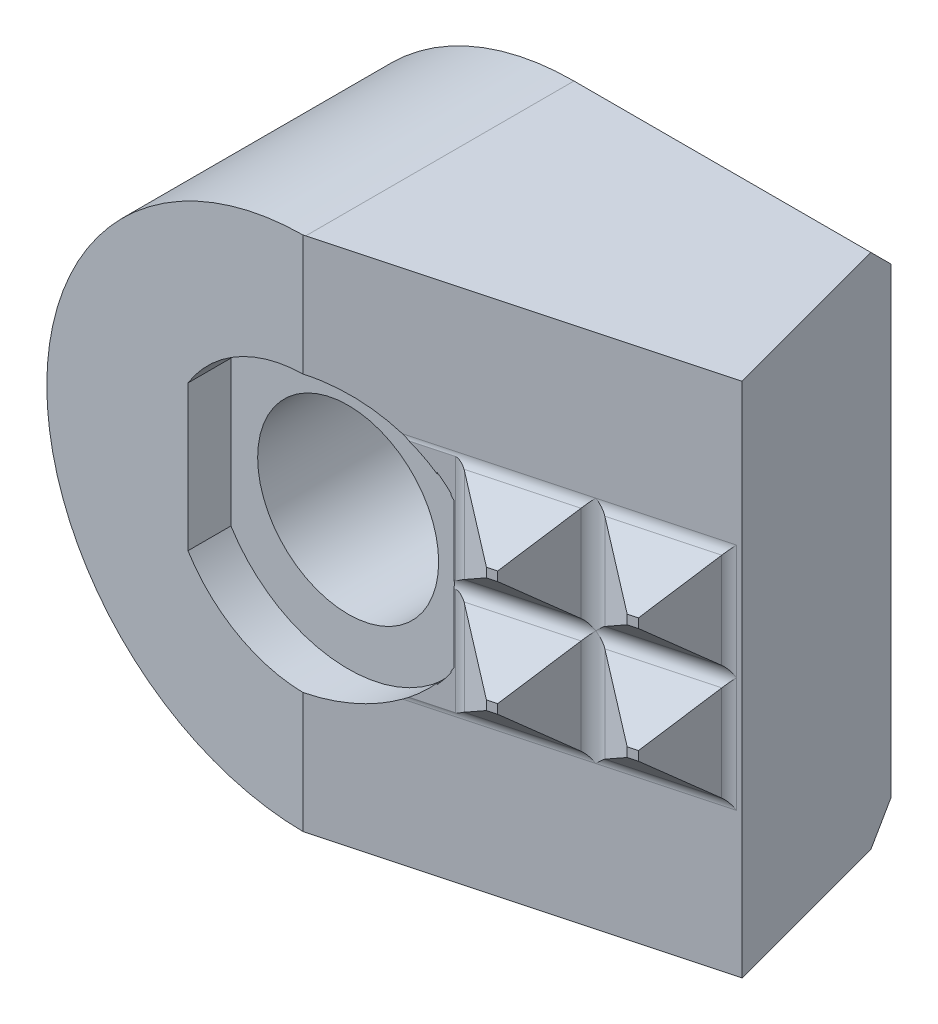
ISO-10303-21;
HEADER;
FILE_DESCRIPTION(('STEP AP214'),'2;1');
FILE_NAME('part.step','',(''),(''),'','','');
FILE_SCHEMA(('AUTOMOTIVE_DESIGN { 1 0 10303 214 1 1 1 1 }'));
ENDSEC;
DATA;
#1=APPLICATION_CONTEXT('core data for automotive mechanical design processes');
#2=APPLICATION_PROTOCOL_DEFINITION('international standard','automotive_design',2000,#1);
#3=PRODUCT_CONTEXT('',#1,'mechanical');
#4=PRODUCT('Part','Part','',(#3));
#5=PRODUCT_RELATED_PRODUCT_CATEGORY('part','',(#4));
#6=PRODUCT_DEFINITION_FORMATION('','',#4);
#7=PRODUCT_DEFINITION_CONTEXT('part definition',#1,'design');
#8=PRODUCT_DEFINITION('design','',#6,#7);
#9=PRODUCT_DEFINITION_SHAPE('','',#8);
#10=(LENGTH_UNIT() NAMED_UNIT(*) SI_UNIT(.MILLI.,.METRE.));
#11=(NAMED_UNIT(*) PLANE_ANGLE_UNIT() SI_UNIT($,.RADIAN.));
#12=(NAMED_UNIT(*) SI_UNIT($,.STERADIAN.) SOLID_ANGLE_UNIT());
#13=UNCERTAINTY_MEASURE_WITH_UNIT(LENGTH_MEASURE(1.E-05),#10,'distance_accuracy_value','');
#14=(GEOMETRIC_REPRESENTATION_CONTEXT(3) GLOBAL_UNCERTAINTY_ASSIGNED_CONTEXT((#13)) GLOBAL_UNIT_ASSIGNED_CONTEXT((#10,
#11,#12)) REPRESENTATION_CONTEXT('',''));
#15=CARTESIAN_POINT('',(0.,0.,0.));
#16=DIRECTION('',(0.,0.,1.));
#17=DIRECTION('',(1.,0.,0.));
#18=AXIS2_PLACEMENT_3D('',#15,#16,#17);
#19=CARTESIAN_POINT('',(8.3114167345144,-7.1374,7.29212002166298));
#20=DIRECTION('',(-0.258819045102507,0.,-0.965925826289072));
#21=DIRECTION('',(0.965925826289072,0.,-0.258819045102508));
#22=AXIS2_PLACEMENT_3D('',#19,#20,#21);
#23=PLANE('',#22);
#24=DIRECTION('',(0.,1.,0.));
#25=VECTOR('',#24,1.);
#26=CARTESIAN_POINT('',(8.3114167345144,-7.1374,7.29212002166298));
#27=LINE('',#26,#25);
#28=CARTESIAN_POINT('',(8.3114167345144,-1.7145,7.29212002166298));
#29=VERTEX_POINT('',#28);
#30=CARTESIAN_POINT('',(8.3114167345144,-1.4605,7.29212002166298));
#31=VERTEX_POINT('',#30);
#32=EDGE_CURVE('E554',#29,#31,#27,.T.);
#33=ORIENTED_EDGE('',*,*,#32,.T.);
#34=DIRECTION('',(0.965925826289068,0.,-0.258819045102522));
#35=VECTOR('',#34,1.);
#36=CARTESIAN_POINT('',(-6.32623001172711,-1.4605,11.2142656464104));
#37=LINE('',#36,#35);
#38=CARTESIAN_POINT('',(8.066071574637,-1.4605,7.35786005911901));
#39=VERTEX_POINT('',#38);
#40=EDGE_CURVE('E365',#39,#31,#37,.T.);
#41=ORIENTED_EDGE('',*,*,#40,.F.);
#42=DIRECTION('',(0.,1.,0.));
#43=VECTOR('',#42,1.);
#44=CARTESIAN_POINT('',(8.066071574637,-7.1374,7.35786005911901));
#45=LINE('',#44,#43);
#46=CARTESIAN_POINT('',(8.066071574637,-1.7145,7.35786005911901));
#47=VERTEX_POINT('',#46);
#48=EDGE_CURVE('E558',#47,#39,#45,.T.);
#49=ORIENTED_EDGE('',*,*,#48,.F.);
#50=DIRECTION('',(0.965925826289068,0.,-0.258819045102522));
#51=VECTOR('',#50,1.);
#52=CARTESIAN_POINT('',(-6.32623001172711,-1.7145,11.2142656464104));
#53=LINE('',#52,#51);
#54=EDGE_CURVE('E368',#47,#29,#53,.T.);
#55=ORIENTED_EDGE('',*,*,#54,.T.);
#56=EDGE_LOOP('',(#33,#41,#49,#55));
#57=FACE_BOUND('',#56,.T.);
#58=ADVANCED_FACE('F16',(#57),#23,.F.);
#59=CARTESIAN_POINT('',(-6.32623001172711,-1.4605,11.2142656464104));
#60=DIRECTION('',(-0.18301270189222,-0.707106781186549,-0.683012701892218));
#61=DIRECTION('',(0.,0.694746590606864,-0.719254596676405));
#62=AXIS2_PLACEMENT_3D('',#59,#60,#61);
#63=PLANE('',#62);
#64=DIRECTION('',(0.965925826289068,0.,-0.258819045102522));
#65=VECTOR('',#64,1.);
#66=CARTESIAN_POINT('',(-6.6345073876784,-0.269407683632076,10.0637588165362));
#67=LINE('',#66,#65);
#68=CARTESIAN_POINT('',(6.60728736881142,-0.269407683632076,6.51563060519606));
#69=VERTEX_POINT('',#68);
#70=CARTESIAN_POINT('',(9.15364618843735,-0.269407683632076,5.83333581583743));
#71=VERTEX_POINT('',#70);
#72=EDGE_CURVE('E361',#69,#71,#67,.T.);
#73=ORIENTED_EDGE('',*,*,#72,.F.);
#74=DIRECTION('',(-0.707106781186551,0.577350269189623,-0.408248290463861));
#75=VECTOR('',#74,1.);
#76=CARTESIAN_POINT('',(10.3836562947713,-3.3528,8.6959182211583));
#77=LINE('',#76,#75);
#78=EDGE_CURVE('E487',#39,#69,#77,.T.);
#79=ORIENTED_EDGE('',*,*,#78,.F.);
#80=ORIENTED_EDGE('',*,*,#40,.T.);
#81=DIRECTION('',(-0.408248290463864,-0.577350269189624,0.707106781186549));
#82=VECTOR('',#81,1.);
#83=CARTESIAN_POINT('',(7.5348448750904,-2.55873845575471,8.63718193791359));
#84=LINE('',#83,#82);
#85=EDGE_CURVE('E490',#71,#31,#84,.T.);
#86=ORIENTED_EDGE('',*,*,#85,.F.);
#87=EDGE_LOOP('',(#73,#79,#80,#86));
#88=FACE_BOUND('',#87,.T.);
#89=ADVANCED_FACE('F653',(#88),#63,.F.);
#90=CARTESIAN_POINT('',(-6.32623001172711,1.4605,11.2142656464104));
#91=DIRECTION('',(0.18301270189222,-0.707106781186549,0.683012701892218));
#92=DIRECTION('',(0.,-0.694746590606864,-0.719254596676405));
#93=AXIS2_PLACEMENT_3D('',#90,#91,#92);
#94=PLANE('',#93);
#95=DIRECTION('',(-0.408248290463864,0.577350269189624,0.707106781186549));
#96=VECTOR('',#95,1.);
#97=CARTESIAN_POINT('',(10.8994475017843,-2.19952821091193,2.80951924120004));
#98=LINE('',#97,#96);
#99=CARTESIAN_POINT('',(9.15364618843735,0.269407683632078,5.83333581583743));
#100=VERTEX_POINT('',#99);
#101=CARTESIAN_POINT('',(8.3114167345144,1.4605,7.29212002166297));
#102=VERTEX_POINT('',#101);
#103=EDGE_CURVE('E499',#100,#102,#98,.T.);
#104=ORIENTED_EDGE('',*,*,#103,.T.);
#105=DIRECTION('',(0.965925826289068,0.,-0.258819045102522));
#106=VECTOR('',#105,1.);
#107=CARTESIAN_POINT('',(-6.32623001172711,1.4605,11.2142656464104));
#108=LINE('',#107,#106);
#109=CARTESIAN_POINT('',(8.066071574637,1.4605,7.35786005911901));
#110=VERTEX_POINT('',#109);
#111=EDGE_CURVE('E353',#110,#102,#108,.T.);
#112=ORIENTED_EDGE('',*,*,#111,.F.);
#113=DIRECTION('',(-0.707106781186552,-0.577350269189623,-0.408248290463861));
#114=VECTOR('',#113,1.);
#115=CARTESIAN_POINT('',(4.55599359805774,-1.40546666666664,5.33131559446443));
#116=LINE('',#115,#114);
#117=CARTESIAN_POINT('',(6.60728736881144,0.269407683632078,6.51563060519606));
#118=VERTEX_POINT('',#117);
#119=EDGE_CURVE('E497',#110,#118,#116,.T.);
#120=ORIENTED_EDGE('',*,*,#119,.T.);
#121=DIRECTION('',(0.965925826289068,0.,-0.258819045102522));
#122=VECTOR('',#121,1.);
#123=CARTESIAN_POINT('',(-6.6345073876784,0.269407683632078,10.0637588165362));
#124=LINE('',#123,#122);
#125=EDGE_CURVE('E357',#118,#100,#124,.T.);
#126=ORIENTED_EDGE('',*,*,#125,.T.);
#127=EDGE_LOOP('',(#104,#112,#120,#126));
#128=FACE_BOUND('',#127,.T.);
#129=ADVANCED_FACE('F652',(#128),#94,.T.);
#130=CARTESIAN_POINT('',(8.3114167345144,1.7145,7.29212002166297));
#131=VERTEX_POINT('',#130);
#132=EDGE_CURVE('E555',#102,#131,#27,.T.);
#133=ORIENTED_EDGE('',*,*,#132,.T.);
#134=DIRECTION('',(0.965925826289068,0.,-0.258819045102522));
#135=VECTOR('',#134,1.);
#136=CARTESIAN_POINT('',(-6.32623001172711,1.7145,11.2142656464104));
#137=LINE('',#136,#135);
#138=CARTESIAN_POINT('',(8.066071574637,1.7145,7.35786005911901));
#139=VERTEX_POINT('',#138);
#140=EDGE_CURVE('E350',#139,#131,#137,.T.);
#141=ORIENTED_EDGE('',*,*,#140,.F.);
#142=EDGE_CURVE('E559',#110,#139,#45,.T.);
#143=ORIENTED_EDGE('',*,*,#142,.F.);
#144=ORIENTED_EDGE('',*,*,#111,.T.);
#145=EDGE_LOOP('',(#133,#141,#143,#144));
#146=FACE_BOUND('',#145,.T.);
#147=ADVANCED_FACE('F664',(#146),#23,.F.);
#148=CARTESIAN_POINT('',(5.24460223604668,-7.1374,8.11387048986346));
#149=DIRECTION('',(-0.258819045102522,0.,-0.965925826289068));
#150=DIRECTION('',(0.965925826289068,0.,-0.258819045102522));
#151=AXIS2_PLACEMENT_3D('',#148,#149,#150);
#152=PLANE('',#151);
#153=DIRECTION('',(0.,1.,0.));
#154=VECTOR('',#153,1.);
#155=CARTESIAN_POINT('',(5.24460223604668,-7.1374,8.11387048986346));
#156=LINE('',#155,#154);
#157=CARTESIAN_POINT('',(5.24460223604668,-1.7145,8.11387048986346));
#158=VERTEX_POINT('',#157);
#159=CARTESIAN_POINT('',(5.24460223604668,-1.4605,8.11387048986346));
#160=VERTEX_POINT('',#159);
#161=EDGE_CURVE('E570',#158,#160,#156,.T.);
#162=ORIENTED_EDGE('',*,*,#161,.T.);
#163=CARTESIAN_POINT('',(4.99925707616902,-1.4605,8.17961052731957));
#164=VERTEX_POINT('',#163);
#165=EDGE_CURVE('E364',#164,#160,#37,.T.);
#166=ORIENTED_EDGE('',*,*,#165,.F.);
#167=DIRECTION('',(0.,1.,0.));
#168=VECTOR('',#167,1.);
#169=CARTESIAN_POINT('',(4.99925707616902,-7.1374,8.17961052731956));
#170=LINE('',#169,#168);
#171=CARTESIAN_POINT('',(4.99925707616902,-1.7145,8.17961052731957));
#172=VERTEX_POINT('',#171);
#173=EDGE_CURVE('E574',#172,#164,#170,.T.);
#174=ORIENTED_EDGE('',*,*,#173,.F.);
#175=EDGE_CURVE('E367',#172,#158,#53,.T.);
#176=ORIENTED_EDGE('',*,*,#175,.T.);
#177=EDGE_LOOP('',(#162,#166,#174,#176));
#178=FACE_BOUND('',#177,.T.);
#179=ADVANCED_FACE('F696',(#178),#152,.F.);
#180=CARTESIAN_POINT('',(6.08683168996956,-7.1374,6.65508628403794));
#181=DIRECTION('',(-0.866025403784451,0.,-0.499999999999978));
#182=DIRECTION('',(0.499999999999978,0.,-0.866025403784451));
#183=AXIS2_PLACEMENT_3D('',#180,#181,#182);
#184=PLANE('',#183);
#185=DIRECTION('',(0.,1.,0.));
#186=VECTOR('',#185,1.);
#187=CARTESIAN_POINT('',(6.08683168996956,-7.1374,6.65508628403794));
#188=LINE('',#187,#186);
#189=CARTESIAN_POINT('',(6.08683168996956,-2.90559231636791,6.65508628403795));
#190=VERTEX_POINT('',#189);
#191=CARTESIAN_POINT('',(6.08683168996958,-0.269407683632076,6.65508628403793));
#192=VERTEX_POINT('',#191);
#193=EDGE_CURVE('E566',#190,#192,#188,.T.);
#194=ORIENTED_EDGE('',*,*,#193,.T.);
#195=DIRECTION('',(-0.408248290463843,-0.577350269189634,0.707106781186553));
#196=VECTOR('',#195,1.);
#197=CARTESIAN_POINT('',(4.46803037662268,-2.55873845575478,9.45893240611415));
#198=LINE('',#197,#196);
#199=EDGE_CURVE('E484',#192,#160,#198,.T.);
#200=ORIENTED_EDGE('',*,*,#199,.T.);
#201=ORIENTED_EDGE('',*,*,#161,.F.);
#202=DIRECTION('',(-0.408248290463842,0.577350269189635,0.707106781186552));
#203=VECTOR('',#202,1.);
#204=CARTESIAN_POINT('',(7.08427832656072,-4.31619487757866,4.92745803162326));
#205=LINE('',#204,#203);
#206=EDGE_CURVE('E475',#190,#158,#205,.T.);
#207=ORIENTED_EDGE('',*,*,#206,.F.);
#208=EDGE_LOOP('',(#194,#200,#201,#207));
#209=FACE_BOUND('',#208,.T.);
#210=ADVANCED_FACE('F702',(#209),#184,.F.);
#211=CARTESIAN_POINT('',(8.066071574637,-7.1374,7.35786005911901));
#212=DIRECTION('',(0.5,0.,-0.866025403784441));
#213=DIRECTION('',(0.866025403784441,0.,0.5));
#214=AXIS2_PLACEMENT_3D('',#211,#212,#213);
#215=PLANE('',#214);
#216=ORIENTED_EDGE('',*,*,#48,.T.);
#217=ORIENTED_EDGE('',*,*,#78,.T.);
#218=DIRECTION('',(0.,1.,0.));
#219=VECTOR('',#218,1.);
#220=CARTESIAN_POINT('',(6.60728736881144,-7.1374,6.51563060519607));
#221=LINE('',#220,#219);
#222=CARTESIAN_POINT('',(6.60728736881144,-2.90559231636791,6.51563060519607));
#223=VERTEX_POINT('',#222);
#224=EDGE_CURVE('E562',#223,#69,#221,.T.);
#225=ORIENTED_EDGE('',*,*,#224,.F.);
#226=DIRECTION('',(-0.707106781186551,-0.577350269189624,-0.408248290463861));
#227=VECTOR('',#226,1.);
#228=CARTESIAN_POINT('',(5.8521819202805,-3.52213333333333,6.07967027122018));
#229=LINE('',#228,#227);
#230=EDGE_CURVE('E477',#47,#223,#229,.T.);
#231=ORIENTED_EDGE('',*,*,#230,.F.);
#232=EDGE_LOOP('',(#216,#217,#225,#231));
#233=FACE_BOUND('',#232,.T.);
#234=ADVANCED_FACE('F812',(#233),#215,.F.);
#235=CARTESIAN_POINT('',(-6.32623001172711,-1.7145,11.2142656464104));
#236=DIRECTION('',(0.18301270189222,-0.707106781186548,0.683012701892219));
#237=DIRECTION('',(0.,-0.694746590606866,-0.719254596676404));
#238=AXIS2_PLACEMENT_3D('',#235,#236,#237);
#239=PLANE('',#238);
#240=DIRECTION('',(-0.408248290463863,0.577350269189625,0.707106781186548));
#241=VECTOR('',#240,1.);
#242=CARTESIAN_POINT('',(10.1510928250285,-4.31619487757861,4.1057075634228));
#243=LINE('',#242,#241);
#244=CARTESIAN_POINT('',(9.15364618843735,-2.90559231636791,5.83333581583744));
#245=VERTEX_POINT('',#244);
#246=EDGE_CURVE('E479',#245,#29,#243,.T.);
#247=ORIENTED_EDGE('',*,*,#246,.T.);
#248=ORIENTED_EDGE('',*,*,#54,.F.);
#249=ORIENTED_EDGE('',*,*,#230,.T.);
#250=DIRECTION('',(0.965925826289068,0.,-0.258819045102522));
#251=VECTOR('',#250,1.);
#252=CARTESIAN_POINT('',(-6.6345073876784,-2.90559231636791,10.0637588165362));
#253=LINE('',#252,#251);
#254=EDGE_CURVE('E372',#223,#245,#253,.T.);
#255=ORIENTED_EDGE('',*,*,#254,.T.);
#256=EDGE_LOOP('',(#247,#248,#249,#255));
#257=FACE_BOUND('',#256,.T.);
#258=ADVANCED_FACE('F407',(#257),#239,.T.);
#259=CARTESIAN_POINT('',(9.15364618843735,-7.1374,5.83333581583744));
#260=DIRECTION('',(-0.866025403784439,0.,-0.5));
#261=DIRECTION('',(0.5,0.,-0.866025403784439));
#262=AXIS2_PLACEMENT_3D('',#259,#260,#261);
#263=PLANE('',#262);
#264=DIRECTION('',(0.,1.,0.));
#265=VECTOR('',#264,1.);
#266=CARTESIAN_POINT('',(9.15364618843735,-7.1374,5.83333581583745));
#267=LINE('',#266,#265);
#268=EDGE_CURVE('E550',#245,#71,#267,.T.);
#269=ORIENTED_EDGE('',*,*,#268,.T.);
#270=ORIENTED_EDGE('',*,*,#85,.T.);
#271=ORIENTED_EDGE('',*,*,#32,.F.);
#272=ORIENTED_EDGE('',*,*,#246,.F.);
#273=EDGE_LOOP('',(#269,#270,#271,#272));
#274=FACE_BOUND('',#273,.T.);
#275=ADVANCED_FACE('F820',(#274),#263,.F.);
#276=CARTESIAN_POINT('',(9.15364618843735,2.90559231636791,5.83333581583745));
#277=VERTEX_POINT('',#276);
#278=EDGE_CURVE('E551',#100,#277,#267,.T.);
#279=ORIENTED_EDGE('',*,*,#278,.T.);
#280=DIRECTION('',(-0.408248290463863,-0.577350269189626,0.707106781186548));
#281=VECTOR('',#280,1.);
#282=CARTESIAN_POINT('',(6.78649019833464,-0.442071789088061,9.93337026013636));
#283=LINE('',#282,#281);
#284=EDGE_CURVE('E510',#277,#131,#283,.T.);
#285=ORIENTED_EDGE('',*,*,#284,.T.);
#286=ORIENTED_EDGE('',*,*,#132,.F.);
#287=ORIENTED_EDGE('',*,*,#103,.F.);
#288=EDGE_LOOP('',(#279,#285,#286,#287));
#289=FACE_BOUND('',#288,.T.);
#290=ADVANCED_FACE('F829',(#289),#263,.F.);
#291=CARTESIAN_POINT('',(-6.32623001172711,1.7145,11.2142656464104));
#292=DIRECTION('',(-0.18301270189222,-0.707106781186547,-0.68301270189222));
#293=DIRECTION('',(0.,0.694746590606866,-0.719254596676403));
#294=AXIS2_PLACEMENT_3D('',#291,#292,#293);
#295=PLANE('',#294);
#296=DIRECTION('',(0.965925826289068,0.,-0.258819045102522));
#297=VECTOR('',#296,1.);
#298=CARTESIAN_POINT('',(-6.6345073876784,2.90559231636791,10.0637588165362));
#299=LINE('',#298,#297);
#300=CARTESIAN_POINT('',(6.60728736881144,2.90559231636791,6.51563060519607));
#301=VERTEX_POINT('',#300);
#302=EDGE_CURVE('E346',#301,#277,#299,.T.);
#303=ORIENTED_EDGE('',*,*,#302,.F.);
#304=DIRECTION('',(-0.70710678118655,0.577350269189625,-0.40824829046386));
#305=VECTOR('',#304,1.);
#306=CARTESIAN_POINT('',(11.679844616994,-1.23613333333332,9.44427289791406));
#307=LINE('',#306,#305);
#308=EDGE_CURVE('E507',#139,#301,#307,.T.);
#309=ORIENTED_EDGE('',*,*,#308,.F.);
#310=ORIENTED_EDGE('',*,*,#140,.T.);
#311=ORIENTED_EDGE('',*,*,#284,.F.);
#312=EDGE_LOOP('',(#303,#309,#310,#311));
#313=FACE_BOUND('',#312,.T.);
#314=ADVANCED_FACE('F441',(#313),#295,.F.);
#315=CARTESIAN_POINT('',(-7.1374,6.3754,0.));
#316=DIRECTION('',(0.,0.707106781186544,-0.707106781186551));
#317=DIRECTION('',(0.,0.707106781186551,0.707106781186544));
#318=AXIS2_PLACEMENT_3D('',#315,#316,#317);
#319=PLANE('',#318);
#320=DIRECTION('',(0.186156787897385,0.694746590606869,0.694746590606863));
#321=VECTOR('',#320,1.);
#322=CARTESIAN_POINT('',(7.47638859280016,4.4175235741,-1.95787642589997));
#323=LINE('',#322,#321);
#324=CARTESIAN_POINT('',(8.001,6.3754,0.));
#325=VERTEX_POINT('',#324);
#326=CARTESIAN_POINT('',(8.2051772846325,7.1374,0.762));
#327=VERTEX_POINT('',#326);
#328=EDGE_CURVE('E586',#325,#327,#323,.T.);
#329=ORIENTED_EDGE('',*,*,#328,.F.);
#330=DIRECTION('',(1.,0.,0.));
#331=VECTOR('',#330,1.);
#332=CARTESIAN_POINT('',(8.001,6.3754,0.));
#333=LINE('',#332,#331);
#334=CARTESIAN_POINT('',(0.,6.3754,0.));
#335=VERTEX_POINT('',#334);
#336=EDGE_CURVE('E590',#335,#325,#333,.T.);
#337=ORIENTED_EDGE('',*,*,#336,.F.);
#338=DIRECTION('',(0.,-0.707106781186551,-0.707106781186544));
#339=VECTOR('',#338,1.);
#340=CARTESIAN_POINT('',(0.,7.1374,0.762));
#341=LINE('',#340,#339);
#342=CARTESIAN_POINT('',(0.,7.1374,0.762));
#343=VERTEX_POINT('',#342);
#344=EDGE_CURVE('E516',#343,#335,#341,.T.);
#345=ORIENTED_EDGE('',*,*,#344,.F.);
#346=DIRECTION('',(-1.,0.,0.));
#347=VECTOR('',#346,1.);
#348=CARTESIAN_POINT('',(0.,7.1374,0.762));
#349=LINE('',#348,#347);
#350=EDGE_CURVE('E598',#327,#343,#349,.T.);
#351=ORIENTED_EDGE('',*,*,#350,.F.);
#352=EDGE_LOOP('',(#329,#337,#345,#351));
#353=FACE_BOUND('',#352,.T.);
#354=ADVANCED_FACE('F861',(#353),#319,.T.);
#355=CARTESIAN_POINT('',(3.3693967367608,-7.1374,0.762000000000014));
#356=DIRECTION('',(0.,0.707106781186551,0.707106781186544));
#357=DIRECTION('',(0.,-0.707106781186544,0.707106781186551));
#358=AXIS2_PLACEMENT_3D('',#355,#356,#357);
#359=PLANE('',#358);
#360=DIRECTION('',(0.,0.707106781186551,-0.707106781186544));
#361=VECTOR('',#360,1.);
#362=CARTESIAN_POINT('',(0.,-7.1374,0.762));
#363=LINE('',#362,#361);
#364=CARTESIAN_POINT('',(0.,-7.1374,0.762));
#365=VERTEX_POINT('',#364);
#366=CARTESIAN_POINT('',(0.,-6.3754,0.));
#367=VERTEX_POINT('',#366);
#368=EDGE_CURVE('E513',#365,#367,#363,.T.);
#369=ORIENTED_EDGE('',*,*,#368,.T.);
#370=DIRECTION('',(-1.,0.,0.));
#371=VECTOR('',#370,1.);
#372=CARTESIAN_POINT('',(-7.1374,-6.3754,0.));
#373=LINE('',#372,#371);
#374=CARTESIAN_POINT('',(8.001,-6.3754,0.));
#375=VERTEX_POINT('',#374);
#376=EDGE_CURVE('E594',#375,#367,#373,.T.);
#377=ORIENTED_EDGE('',*,*,#376,.F.);
#378=DIRECTION('',(0.186156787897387,-0.694746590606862,0.694746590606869));
#379=VECTOR('',#378,1.);
#380=CARTESIAN_POINT('',(8.0375964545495,-6.51197982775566,0.136579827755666));
#381=LINE('',#380,#379);
#382=CARTESIAN_POINT('',(8.2051772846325,-7.1374,0.762000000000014));
#383=VERTEX_POINT('',#382);
#384=EDGE_CURVE('E588',#383,#375,#381,.F.);
#385=ORIENTED_EDGE('',*,*,#384,.F.);
#386=DIRECTION('',(1.,0.,0.));
#387=VECTOR('',#386,1.);
#388=CARTESIAN_POINT('',(3.3693967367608,-7.1374,0.762000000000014));
#389=LINE('',#388,#387);
#390=EDGE_CURVE('E543',#365,#383,#389,.T.);
#391=ORIENTED_EDGE('',*,*,#390,.F.);
#392=EDGE_LOOP('',(#369,#377,#385,#391));
#393=FACE_BOUND('',#392,.T.);
#394=ADVANCED_FACE('F409',(#393),#359,.F.);
#395=CARTESIAN_POINT('',(0.,0.,0.));
#396=DIRECTION('',(0.,0.,1.));
#397=DIRECTION('',(0.,-1.,0.));
#398=AXIS2_PLACEMENT_3D('',#395,#396,#397);
#399=CONICAL_SURFACE('',#398,6.3754,0.785398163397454);
#400=ORIENTED_EDGE('',*,*,#344,.T.);
#401=CARTESIAN_POINT('',(0.,0.,0.));
#402=DIRECTION('',(0.,0.,1.));
#403=DIRECTION('',(0.,-1.,0.));
#404=AXIS2_PLACEMENT_3D('',#401,#402,#403);
#405=CIRCLE('',#404,6.3754);
#406=EDGE_CURVE('E592',#367,#335,#405,.F.);
#407=ORIENTED_EDGE('',*,*,#406,.F.);
#408=ORIENTED_EDGE('',*,*,#368,.F.);
#409=CARTESIAN_POINT('',(0.,0.,0.762));
#410=DIRECTION('',(0.,0.,1.));
#411=DIRECTION('',(0.,-1.,0.));
#412=AXIS2_PLACEMENT_3D('',#409,#410,#411);
#413=CIRCLE('',#412,7.1374);
#414=EDGE_CURVE('E596',#343,#365,#413,.T.);
#415=ORIENTED_EDGE('',*,*,#414,.F.);
#416=EDGE_LOOP('',(#400,#407,#408,#415));
#417=FACE_BOUND('',#416,.T.);
#418=ADVANCED_FACE('F650',(#417),#399,.T.);
#419=CARTESIAN_POINT('',(-6.56477954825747,0.,10.3239866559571));
#420=DIRECTION('',(0.965925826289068,0.,-0.258819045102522));
#421=DIRECTION('',(0.258819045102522,0.,0.965925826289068));
#422=AXIS2_PLACEMENT_3D('',#419,#420,#421);
#423=CYLINDRICAL_SURFACE('',#422,0.381);
#424=ORIENTED_EDGE('',*,*,#125,.F.);
#425=CARTESIAN_POINT('',(6.41678736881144,0.,6.84558628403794));
#426=DIRECTION('',(-0.683012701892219,0.707106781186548,0.18301270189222));
#427=DIRECTION('',(0.683012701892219,0.707106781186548,-0.18301270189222));
#428=AXIS2_PLACEMENT_3D('',#425,#426,#427);
#429=ELLIPSE('',#428,0.538815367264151,0.381);
#430=CARTESIAN_POINT('',(6.31817731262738,0.,6.4775685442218));
#431=VERTEX_POINT('',#430);
#432=EDGE_CURVE('E713',#431,#118,#429,.F.);
#433=ORIENTED_EDGE('',*,*,#432,.F.);
#434=CARTESIAN_POINT('',(6.41678736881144,0.,6.84558628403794));
#435=DIRECTION('',(0.683012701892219,0.707106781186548,-0.18301270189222));
#436=DIRECTION('',(-0.683012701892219,0.707106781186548,0.18301270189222));
#437=AXIS2_PLACEMENT_3D('',#434,#435,#436);
#438=ELLIPSE('',#437,0.538815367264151,0.381);
#439=EDGE_CURVE('E711',#69,#431,#438,.T.);
#440=ORIENTED_EDGE('',*,*,#439,.F.);
#441=ORIENTED_EDGE('',*,*,#72,.T.);
#442=CARTESIAN_POINT('',(9.48360186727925,0.,6.02383581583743));
#443=DIRECTION('',(-0.683012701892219,0.707106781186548,0.18301270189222));
#444=DIRECTION('',(0.683012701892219,0.707106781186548,-0.18301270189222));
#445=AXIS2_PLACEMENT_3D('',#442,#443,#444);
#446=ELLIPSE('',#445,0.538815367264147,0.381);
#447=CARTESIAN_POINT('',(9.38499181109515,0.,5.6558180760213));
#448=VERTEX_POINT('',#447);
#449=EDGE_CURVE('E720',#448,#71,#446,.T.);
#450=ORIENTED_EDGE('',*,*,#449,.F.);
#451=CARTESIAN_POINT('',(9.48360186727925,0.,6.02383581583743));
#452=DIRECTION('',(0.683012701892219,0.707106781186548,-0.18301270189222));
#453=DIRECTION('',(-0.683012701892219,0.707106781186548,0.18301270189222));
#454=AXIS2_PLACEMENT_3D('',#451,#452,#453);
#455=ELLIPSE('',#454,0.538815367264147,0.381);
#456=EDGE_CURVE('E722',#100,#448,#455,.F.);
#457=ORIENTED_EDGE('',*,*,#456,.F.);
#458=EDGE_LOOP('',(#424,#433,#440,#441,#450,#457));
#459=FACE_BOUND('',#458,.T.);
#460=ADVANCED_FACE('F646',(#459),#423,.F.);
#461=ORIENTED_EDGE('',*,*,#142,.T.);
#462=ORIENTED_EDGE('',*,*,#308,.T.);
#463=EDGE_CURVE('E563',#118,#301,#221,.T.);
#464=ORIENTED_EDGE('',*,*,#463,.F.);
#465=ORIENTED_EDGE('',*,*,#119,.F.);
#466=EDGE_LOOP('',(#461,#462,#464,#465));
#467=FACE_BOUND('',#466,.T.);
#468=ADVANCED_FACE('F649',(#467),#215,.F.);
#469=CARTESIAN_POINT('',(6.08683168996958,0.269407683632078,6.65508628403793));
#470=VERTEX_POINT('',#469);
#471=CARTESIAN_POINT('',(6.08683168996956,2.90559231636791,6.65508628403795));
#472=VERTEX_POINT('',#471);
#473=EDGE_CURVE('E567',#470,#472,#188,.T.);
#474=ORIENTED_EDGE('',*,*,#473,.T.);
#475=DIRECTION('',(-0.408248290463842,-0.577350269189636,0.707106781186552));
#476=VECTOR('',#475,1.);
#477=CARTESIAN_POINT('',(3.71967569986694,-0.442071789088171,10.7551207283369));
#478=LINE('',#477,#476);
#479=CARTESIAN_POINT('',(5.24460223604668,1.7145,8.11387048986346));
#480=VERTEX_POINT('',#479);
#481=EDGE_CURVE('E504',#472,#480,#478,.T.);
#482=ORIENTED_EDGE('',*,*,#481,.T.);
#483=CARTESIAN_POINT('',(5.24460223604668,1.4605,8.11387048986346));
#484=VERTEX_POINT('',#483);
#485=EDGE_CURVE('E571',#484,#480,#156,.T.);
#486=ORIENTED_EDGE('',*,*,#485,.F.);
#487=DIRECTION('',(-0.408248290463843,0.577350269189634,0.707106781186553));
#488=VECTOR('',#487,1.);
#489=CARTESIAN_POINT('',(7.83263300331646,-2.19952821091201,3.63126970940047));
#490=LINE('',#489,#488);
#491=EDGE_CURVE('E495',#470,#484,#490,.T.);
#492=ORIENTED_EDGE('',*,*,#491,.F.);
#493=EDGE_LOOP('',(#474,#482,#486,#492));
#494=FACE_BOUND('',#493,.T.);
#495=ADVANCED_FACE('F847',(#494),#184,.F.);
#496=ORIENTED_EDGE('',*,*,#485,.T.);
#497=CARTESIAN_POINT('',(4.99925707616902,1.7145,8.17961052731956));
#498=VERTEX_POINT('',#497);
#499=EDGE_CURVE('E349',#498,#480,#137,.T.);
#500=ORIENTED_EDGE('',*,*,#499,.F.);
#501=CARTESIAN_POINT('',(4.99925707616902,1.4605,8.17961052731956));
#502=VERTEX_POINT('',#501);
#503=EDGE_CURVE('E575',#502,#498,#170,.T.);
#504=ORIENTED_EDGE('',*,*,#503,.F.);
#505=EDGE_CURVE('E352',#502,#484,#108,.T.);
#506=ORIENTED_EDGE('',*,*,#505,.T.);
#507=EDGE_LOOP('',(#496,#500,#504,#506));
#508=FACE_BOUND('',#507,.T.);
#509=ADVANCED_FACE('F850',(#508),#152,.F.);
#510=CARTESIAN_POINT('',(-7.1374,-7.1374,0.));
#511=DIRECTION('',(0.,0.,1.));
#512=DIRECTION('',(0.,-1.,0.));
#513=AXIS2_PLACEMENT_3D('',#510,#511,#512);
#514=PLANE('',#513);
#515=CARTESIAN_POINT('',(0.,0.,0.));
#516=DIRECTION('',(0.,0.,1.));
#517=DIRECTION('',(0.,-1.,0.));
#518=AXIS2_PLACEMENT_3D('',#515,#516,#517);
#519=CIRCLE('',#518,2.5);
#520=CARTESIAN_POINT('',(0.,-2.5,0.));
#521=VERTEX_POINT('',#520);
#522=EDGE_CURVE('E760',#521,#521,#519,.T.);
#523=ORIENTED_EDGE('',*,*,#522,.T.);
#524=EDGE_LOOP('',(#523));
#525=FACE_BOUND('',#524,.T.);
#526=DIRECTION('',(0.,1.,0.));
#527=VECTOR('',#526,1.);
#528=CARTESIAN_POINT('',(8.001,-7.1374,0.));
#529=LINE('',#528,#527);
#530=EDGE_CURVE('E540',#375,#325,#529,.T.);
#531=ORIENTED_EDGE('',*,*,#530,.F.);
#532=ORIENTED_EDGE('',*,*,#376,.T.);
#533=ORIENTED_EDGE('',*,*,#406,.T.);
#534=ORIENTED_EDGE('',*,*,#336,.T.);
#535=EDGE_LOOP('',(#531,#532,#533,#534));
#536=FACE_BOUND('',#535,.T.);
#537=ADVANCED_FACE('F917',(#525,#536),#514,.F.);
#538=CARTESIAN_POINT('',(4.99925707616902,-7.1374,8.17961052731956));
#539=DIRECTION('',(0.500000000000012,0.,-0.866025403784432));
#540=DIRECTION('',(0.866025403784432,0.,0.500000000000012));
#541=AXIS2_PLACEMENT_3D('',#538,#539,#540);
#542=PLANE('',#541);
#543=ORIENTED_EDGE('',*,*,#503,.T.);
#544=DIRECTION('',(-0.707106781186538,0.577350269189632,-0.408248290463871));
#545=VECTOR('',#544,1.);
#546=CARTESIAN_POINT('',(8.6130301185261,-1.23613333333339,10.2660233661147));
#547=LINE('',#546,#545);
#548=CARTESIAN_POINT('',(3.55989673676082,2.8897327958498,7.34859544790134));
#549=VERTEX_POINT('',#548);
#550=EDGE_CURVE('E501',#498,#549,#547,.T.);
#551=ORIENTED_EDGE('',*,*,#550,.T.);
#552=DIRECTION('',(0.,1.,0.));
#553=VECTOR('',#552,1.);
#554=CARTESIAN_POINT('',(3.55989673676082,-7.1374,7.34859544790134));
#555=LINE('',#554,#553);
#556=CARTESIAN_POINT('',(3.55989673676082,0.285267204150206,7.34859544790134));
#557=VERTEX_POINT('',#556);
#558=EDGE_CURVE('E579',#557,#549,#555,.T.);
#559=ORIENTED_EDGE('',*,*,#558,.F.);
#560=DIRECTION('',(-0.70710678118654,-0.57735026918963,-0.408248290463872));
#561=VECTOR('',#560,1.);
#562=CARTESIAN_POINT('',(1.48917909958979,-1.40546666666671,6.1530660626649));
#563=LINE('',#562,#561);
#564=EDGE_CURVE('E493',#502,#557,#563,.T.);
#565=ORIENTED_EDGE('',*,*,#564,.F.);
#566=EDGE_LOOP('',(#543,#551,#559,#565));
#567=FACE_BOUND('',#566,.T.);
#568=ADVANCED_FACE('F680',(#567),#542,.F.);
#569=ORIENTED_EDGE('',*,*,#491,.T.);
#570=ORIENTED_EDGE('',*,*,#505,.F.);
#571=ORIENTED_EDGE('',*,*,#564,.T.);
#572=CARTESIAN_POINT('',(3.3693967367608,0.554674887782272,7.67855112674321));
#573=DIRECTION('',(0.18301270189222,-0.707106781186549,0.683012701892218));
#574=DIRECTION('',(0.18301270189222,0.707106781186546,0.683012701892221));
#575=AXIS2_PLACEMENT_3D('',#572,#573,#574);
#576=ELLIPSE('',#575,0.538815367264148,0.381);
#577=CARTESIAN_POINT('',(3.53951277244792,0.269407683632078,7.33763833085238));
#578=VERTEX_POINT('',#577);
#579=EDGE_CURVE('E605',#557,#578,#576,.F.);
#580=ORIENTED_EDGE('',*,*,#579,.T.);
#581=EDGE_CURVE('E356',#578,#470,#124,.T.);
#582=ORIENTED_EDGE('',*,*,#581,.T.);
#583=EDGE_LOOP('',(#569,#570,#571,#580,#582));
#584=FACE_BOUND('',#583,.T.);
#585=ADVANCED_FACE('F666',(#584),#94,.T.);
#586=CARTESIAN_POINT('',(3.53951277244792,-0.269407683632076,7.33763833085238));
#587=VERTEX_POINT('',#586);
#588=EDGE_CURVE('E360',#587,#192,#67,.T.);
#589=ORIENTED_EDGE('',*,*,#588,.F.);
#590=CARTESIAN_POINT('',(3.3693967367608,-0.554674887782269,7.67855112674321));
#591=DIRECTION('',(-0.18301270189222,-0.707106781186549,-0.683012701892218));
#592=DIRECTION('',(-0.18301270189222,0.707106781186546,-0.683012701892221));
#593=AXIS2_PLACEMENT_3D('',#590,#591,#592);
#594=ELLIPSE('',#593,0.538815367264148,0.381);
#595=CARTESIAN_POINT('',(3.55989673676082,-0.285267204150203,7.34859544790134));
#596=VERTEX_POINT('',#595);
#597=EDGE_CURVE('E602',#596,#587,#594,.F.);
#598=ORIENTED_EDGE('',*,*,#597,.F.);
#599=DIRECTION('',(-0.70710678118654,0.57735026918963,-0.408248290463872));
#600=VECTOR('',#599,1.);
#601=CARTESIAN_POINT('',(7.31684179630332,-3.3528,9.5176686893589));
#602=LINE('',#601,#600);
#603=EDGE_CURVE('E481',#164,#596,#602,.T.);
#604=ORIENTED_EDGE('',*,*,#603,.F.);
#605=ORIENTED_EDGE('',*,*,#165,.T.);
#606=ORIENTED_EDGE('',*,*,#199,.F.);
#607=EDGE_LOOP('',(#589,#598,#604,#605,#606));
#608=FACE_BOUND('',#607,.T.);
#609=ADVANCED_FACE('F657',(#608),#63,.F.);
#610=ORIENTED_EDGE('',*,*,#173,.T.);
#611=ORIENTED_EDGE('',*,*,#603,.T.);
#612=CARTESIAN_POINT('',(3.55989673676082,-2.8897327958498,7.34859544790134));
#613=VERTEX_POINT('',#612);
#614=EDGE_CURVE('E578',#613,#596,#555,.T.);
#615=ORIENTED_EDGE('',*,*,#614,.F.);
#616=DIRECTION('',(-0.707106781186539,-0.577350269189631,-0.408248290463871));
#617=VECTOR('',#616,1.);
#618=CARTESIAN_POINT('',(2.78536742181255,-3.52213333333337,6.90142073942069));
#619=LINE('',#618,#617);
#620=EDGE_CURVE('E473',#172,#613,#619,.T.);
#621=ORIENTED_EDGE('',*,*,#620,.F.);
#622=EDGE_LOOP('',(#610,#611,#615,#621));
#623=FACE_BOUND('',#622,.T.);
#624=ADVANCED_FACE('F671',(#623),#542,.F.);
#625=ORIENTED_EDGE('',*,*,#206,.T.);
#626=ORIENTED_EDGE('',*,*,#175,.F.);
#627=ORIENTED_EDGE('',*,*,#620,.T.);
#628=CARTESIAN_POINT('',(3.3693967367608,-2.62032511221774,7.67855112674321));
#629=DIRECTION('',(0.18301270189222,-0.707106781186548,0.683012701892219));
#630=DIRECTION('',(0.18301270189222,0.707106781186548,0.683012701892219));
#631=AXIS2_PLACEMENT_3D('',#628,#629,#630);
#632=ELLIPSE('',#631,0.538815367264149,0.381);
#633=CARTESIAN_POINT('',(3.53951277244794,-2.90559231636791,7.33763833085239));
#634=VERTEX_POINT('',#633);
#635=EDGE_CURVE('E600',#613,#634,#632,.F.);
#636=ORIENTED_EDGE('',*,*,#635,.T.);
#637=EDGE_CURVE('E371',#634,#190,#253,.T.);
#638=ORIENTED_EDGE('',*,*,#637,.T.);
#639=EDGE_LOOP('',(#625,#626,#627,#636,#638));
#640=FACE_BOUND('',#639,.T.);
#641=ADVANCED_FACE('F678',(#640),#239,.T.);
#642=CARTESIAN_POINT('',(6.41678736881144,-7.1374,6.84558628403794));
#643=DIRECTION('',(0.,1.,0.));
#644=DIRECTION('',(0.,0.,1.));
#645=AXIS2_PLACEMENT_3D('',#642,#643,#644);
#646=CYLINDRICAL_SURFACE('',#645,0.381);
#647=ORIENTED_EDGE('',*,*,#224,.T.);
#648=ORIENTED_EDGE('',*,*,#439,.T.);
#649=CARTESIAN_POINT('',(6.41678736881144,0.,6.84558628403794));
#650=DIRECTION('',(-0.683012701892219,0.707106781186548,0.18301270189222));
#651=DIRECTION('',(0.683012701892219,0.707106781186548,-0.18301270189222));
#652=AXIS2_PLACEMENT_3D('',#649,#650,#651);
#653=ELLIPSE('',#652,0.538815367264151,0.381);
#654=EDGE_CURVE('E710',#431,#192,#653,.T.);
#655=ORIENTED_EDGE('',*,*,#654,.T.);
#656=ORIENTED_EDGE('',*,*,#193,.F.);
#657=CARTESIAN_POINT('',(6.41678736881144,-3.175,6.84558628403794));
#658=DIRECTION('',(0.683012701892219,0.707106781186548,-0.18301270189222));
#659=DIRECTION('',(-0.683012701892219,0.707106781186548,0.18301270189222));
#660=AXIS2_PLACEMENT_3D('',#657,#658,#659);
#661=ELLIPSE('',#660,0.53881536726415,0.381);
#662=CARTESIAN_POINT('',(6.3181773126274,-3.175,6.47756854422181));
#663=VERTEX_POINT('',#662);
#664=EDGE_CURVE('E631',#663,#190,#661,.T.);
#665=ORIENTED_EDGE('',*,*,#664,.F.);
#666=CARTESIAN_POINT('',(6.41678736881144,-3.175,6.84558628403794));
#667=DIRECTION('',(-0.683012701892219,0.707106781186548,0.18301270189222));
#668=DIRECTION('',(0.683012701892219,0.707106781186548,-0.18301270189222));
#669=AXIS2_PLACEMENT_3D('',#666,#667,#668);
#670=ELLIPSE('',#669,0.53881536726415,0.381);
#671=EDGE_CURVE('E394',#223,#663,#670,.T.);
#672=ORIENTED_EDGE('',*,*,#671,.F.);
#673=EDGE_LOOP('',(#647,#648,#655,#656,#665,#672));
#674=FACE_BOUND('',#673,.T.);
#675=ADVANCED_FACE('F707',(#674),#646,.F.);
#676=CARTESIAN_POINT('',(-6.56477954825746,-3.175,10.3239866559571));
#677=DIRECTION('',(0.965925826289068,0.,-0.258819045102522));
#678=DIRECTION('',(0.258819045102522,0.,0.965925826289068));
#679=AXIS2_PLACEMENT_3D('',#676,#677,#678);
#680=CYLINDRICAL_SURFACE('',#679,0.381);
#681=CARTESIAN_POINT('',(9.48360186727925,-3.175,6.02383581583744));
#682=DIRECTION('',(0.683012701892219,0.707106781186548,-0.18301270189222));
#683=DIRECTION('',(-0.683012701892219,0.707106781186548,0.18301270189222));
#684=AXIS2_PLACEMENT_3D('',#681,#682,#683);
#685=ELLIPSE('',#684,0.538815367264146,0.381);
#686=CARTESIAN_POINT('',(9.38499181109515,-3.175,5.65581807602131));
#687=VERTEX_POINT('',#686);
#688=EDGE_CURVE('E627',#687,#245,#685,.T.);
#689=ORIENTED_EDGE('',*,*,#688,.T.);
#690=ORIENTED_EDGE('',*,*,#254,.F.);
#691=ORIENTED_EDGE('',*,*,#671,.T.);
#692=DIRECTION('',(0.965925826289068,0.,-0.258819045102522));
#693=VECTOR('',#692,1.);
#694=CARTESIAN_POINT('',(-6.66338960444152,-3.175,9.95596891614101));
#695=LINE('',#694,#693);
#696=EDGE_CURVE('E340',#663,#687,#695,.T.);
#697=ORIENTED_EDGE('',*,*,#696,.T.);
#698=EDGE_LOOP('',(#689,#690,#691,#697));
#699=FACE_BOUND('',#698,.T.);
#700=ADVANCED_FACE('F406',(#699),#680,.F.);
#701=CARTESIAN_POINT('',(9.48360186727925,-7.1374,6.02383581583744));
#702=DIRECTION('',(0.,1.,0.));
#703=DIRECTION('',(0.,0.,1.));
#704=AXIS2_PLACEMENT_3D('',#701,#702,#703);
#705=CYLINDRICAL_SURFACE('',#704,0.381);
#706=DIRECTION('',(0.,1.,0.));
#707=VECTOR('',#706,1.);
#708=CARTESIAN_POINT('',(9.3849918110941,-7.1374,5.6558180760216));
#709=LINE('',#708,#707);
#710=EDGE_CURVE('E546',#687,#448,#709,.T.);
#711=ORIENTED_EDGE('',*,*,#710,.T.);
#712=ORIENTED_EDGE('',*,*,#449,.T.);
#713=ORIENTED_EDGE('',*,*,#268,.F.);
#714=ORIENTED_EDGE('',*,*,#688,.F.);
#715=EDGE_LOOP('',(#711,#712,#713,#714));
#716=FACE_BOUND('',#715,.T.);
#717=ADVANCED_FACE('F825',(#716),#705,.F.);
#718=CARTESIAN_POINT('',(9.38499181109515,3.175,5.65581807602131));
#719=VERTEX_POINT('',#718);
#720=EDGE_CURVE('E547',#448,#719,#709,.T.);
#721=ORIENTED_EDGE('',*,*,#720,.T.);
#722=CARTESIAN_POINT('',(9.48360186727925,3.175,6.02383581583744));
#723=DIRECTION('',(-0.683012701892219,0.707106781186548,0.18301270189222));
#724=DIRECTION('',(0.683012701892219,0.707106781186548,-0.18301270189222));
#725=AXIS2_PLACEMENT_3D('',#722,#723,#724);
#726=ELLIPSE('',#725,0.538815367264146,0.381);
#727=EDGE_CURVE('E465',#719,#277,#726,.T.);
#728=ORIENTED_EDGE('',*,*,#727,.T.);
#729=ORIENTED_EDGE('',*,*,#278,.F.);
#730=ORIENTED_EDGE('',*,*,#456,.T.);
#731=EDGE_LOOP('',(#721,#728,#729,#730));
#732=FACE_BOUND('',#731,.T.);
#733=ADVANCED_FACE('F438',(#732),#705,.F.);
#734=CARTESIAN_POINT('',(-6.56477954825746,3.175,10.3239866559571));
#735=DIRECTION('',(0.965925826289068,0.,-0.258819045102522));
#736=DIRECTION('',(0.258819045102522,0.,0.965925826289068));
#737=AXIS2_PLACEMENT_3D('',#734,#735,#736);
#738=CYLINDRICAL_SURFACE('',#737,0.381);
#739=DIRECTION('',(0.965925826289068,0.,-0.258819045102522));
#740=VECTOR('',#739,1.);
#741=CARTESIAN_POINT('',(-6.66338960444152,3.175,9.95596891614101));
#742=LINE('',#741,#740);
#743=CARTESIAN_POINT('',(6.3181773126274,3.175,6.47756854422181));
#744=VERTEX_POINT('',#743);
#745=EDGE_CURVE('E341',#744,#719,#742,.T.);
#746=ORIENTED_EDGE('',*,*,#745,.F.);
#747=CARTESIAN_POINT('',(6.41678736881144,3.175,6.84558628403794));
#748=DIRECTION('',(0.683012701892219,0.707106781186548,-0.18301270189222));
#749=DIRECTION('',(-0.683012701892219,0.707106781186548,0.18301270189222));
#750=AXIS2_PLACEMENT_3D('',#747,#748,#749);
#751=ELLIPSE('',#750,0.53881536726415,0.381);
#752=EDGE_CURVE('E462',#301,#744,#751,.T.);
#753=ORIENTED_EDGE('',*,*,#752,.F.);
#754=ORIENTED_EDGE('',*,*,#302,.T.);
#755=ORIENTED_EDGE('',*,*,#727,.F.);
#756=EDGE_LOOP('',(#746,#753,#754,#755));
#757=FACE_BOUND('',#756,.T.);
#758=ADVANCED_FACE('F433',(#757),#738,.F.);
#759=CARTESIAN_POINT('',(3.3693967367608,7.1374,7.67855112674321));
#760=DIRECTION('',(0.,1.,0.));
#761=DIRECTION('',(0.,0.,1.));
#762=AXIS2_PLACEMENT_3D('',#759,#760,#761);
#763=PLANE('',#762);
#764=DIRECTION('',(0.,0.,1.));
#765=VECTOR('',#764,1.);
#766=CARTESIAN_POINT('',(0.,7.1374,0.));
#767=LINE('',#766,#765);
#768=CARTESIAN_POINT('',(0.,7.1374,8.17051905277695));
#769=VERTEX_POINT('',#768);
#770=EDGE_CURVE('E525',#343,#769,#767,.T.);
#771=ORIENTED_EDGE('',*,*,#770,.T.);
#772=DIRECTION('',(0.965925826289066,0.,-0.25881904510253));
#773=VECTOR('',#772,1.);
#774=CARTESIAN_POINT('',(9.3849918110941,7.1374,5.6558180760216));
#775=LINE('',#774,#773);
#776=CARTESIAN_POINT('',(9.5076643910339,7.1374,5.62294805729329));
#777=VERTEX_POINT('',#776);
#778=EDGE_CURVE('E528',#769,#777,#775,.T.);
#779=ORIENTED_EDGE('',*,*,#778,.T.);
#780=DIRECTION('',(0.258819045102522,0.,0.965925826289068));
#781=VECTOR('',#780,1.);
#782=CARTESIAN_POINT('',(8.001,7.1374,0.));
#783=LINE('',#782,#781);
#784=EDGE_CURVE('E531',#327,#777,#783,.T.);
#785=ORIENTED_EDGE('',*,*,#784,.F.);
#786=ORIENTED_EDGE('',*,*,#350,.T.);
#787=EDGE_LOOP('',(#771,#779,#785,#786));
#788=FACE_BOUND('',#787,.T.);
#789=ADVANCED_FACE('F437',(#788),#763,.T.);
#790=CARTESIAN_POINT('',(8.001,-7.1374,0.));
#791=DIRECTION('',(-0.965925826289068,0.,0.258819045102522));
#792=DIRECTION('',(-0.258819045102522,0.,-0.965925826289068));
#793=AXIS2_PLACEMENT_3D('',#790,#791,#792);
#794=PLANE('',#793);
#795=DIRECTION('',(0.258819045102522,0.,0.965925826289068));
#796=VECTOR('',#795,1.);
#797=CARTESIAN_POINT('',(8.001,-7.1374,0.));
#798=LINE('',#797,#796);
#799=CARTESIAN_POINT('',(9.5076643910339,-7.1374,5.62294805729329));
#800=VERTEX_POINT('',#799);
#801=EDGE_CURVE('E537',#383,#800,#798,.T.);
#802=ORIENTED_EDGE('',*,*,#801,.F.);
#803=ORIENTED_EDGE('',*,*,#384,.T.);
#804=ORIENTED_EDGE('',*,*,#530,.T.);
#805=ORIENTED_EDGE('',*,*,#328,.T.);
#806=ORIENTED_EDGE('',*,*,#784,.T.);
#807=DIRECTION('',(0.,1.,0.));
#808=VECTOR('',#807,1.);
#809=CARTESIAN_POINT('',(9.5076643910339,-7.1374,5.62294805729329));
#810=LINE('',#809,#808);
#811=EDGE_CURVE('E544',#800,#777,#810,.T.);
#812=ORIENTED_EDGE('',*,*,#811,.F.);
#813=EDGE_LOOP('',(#802,#803,#804,#805,#806,#812));
#814=FACE_BOUND('',#813,.T.);
#815=ADVANCED_FACE('F934',(#814),#794,.F.);
#816=CARTESIAN_POINT('',(3.3693967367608,-7.1374,7.67855112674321));
#817=DIRECTION('',(0.,1.,0.));
#818=DIRECTION('',(0.,0.,1.));
#819=AXIS2_PLACEMENT_3D('',#816,#817,#818);
#820=PLANE('',#819);
#821=DIRECTION('',(0.965925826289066,0.,-0.25881904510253));
#822=VECTOR('',#821,1.);
#823=CARTESIAN_POINT('',(9.3849918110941,-7.1374,5.6558180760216));
#824=LINE('',#823,#822);
#825=CARTESIAN_POINT('',(0.,-7.1374,8.17051905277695));
#826=VERTEX_POINT('',#825);
#827=EDGE_CURVE('E534',#826,#800,#824,.T.);
#828=ORIENTED_EDGE('',*,*,#827,.F.);
#829=DIRECTION('',(0.,0.,1.));
#830=VECTOR('',#829,1.);
#831=CARTESIAN_POINT('',(0.,-7.1374,0.));
#832=LINE('',#831,#830);
#833=EDGE_CURVE('E522',#365,#826,#832,.T.);
#834=ORIENTED_EDGE('',*,*,#833,.F.);
#835=ORIENTED_EDGE('',*,*,#390,.T.);
#836=ORIENTED_EDGE('',*,*,#801,.T.);
#837=EDGE_LOOP('',(#828,#834,#835,#836));
#838=FACE_BOUND('',#837,.T.);
#839=ADVANCED_FACE('F882',(#838),#820,.F.);
#840=CARTESIAN_POINT('',(0.,0.,0.));
#841=DIRECTION('',(0.,0.,1.));
#842=DIRECTION('',(0.,-1.,0.));
#843=AXIS2_PLACEMENT_3D('',#840,#841,#842);
#844=CYLINDRICAL_SURFACE('',#843,7.1374);
#845=CARTESIAN_POINT('',(0.,0.,8.18693803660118));
#846=DIRECTION('',(0.,0.,-1.));
#847=DIRECTION('',(0.,1.,0.));
#848=AXIS2_PLACEMENT_3D('',#845,#846,#847);
#849=CIRCLE('',#848,7.1374);
#850=CARTESIAN_POINT('',(-0.0612764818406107,-7.13713695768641,8.18693803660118));
#851=VERTEX_POINT('',#850);
#852=CARTESIAN_POINT('',(-0.0612764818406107,7.13713695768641,8.18693803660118));
#853=VERTEX_POINT('',#852);
#854=EDGE_CURVE('E519',#851,#853,#849,.T.);
#855=ORIENTED_EDGE('',*,*,#854,.T.);
#856=CARTESIAN_POINT('',(0.,0.,8.17051905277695));
#857=DIRECTION('',(-0.258819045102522,0.,-0.965925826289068));
#858=DIRECTION('',(-0.965925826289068,0.,0.258819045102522));
#859=AXIS2_PLACEMENT_3D('',#856,#857,#858);
#860=ELLIPSE('',#859,7.38918021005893,7.1374);
#861=EDGE_CURVE('E468',#853,#769,#860,.T.);
#862=ORIENTED_EDGE('',*,*,#861,.T.);
#863=ORIENTED_EDGE('',*,*,#770,.F.);
#864=ORIENTED_EDGE('',*,*,#414,.T.);
#865=ORIENTED_EDGE('',*,*,#833,.T.);
#866=CARTESIAN_POINT('',(0.,0.,8.17051905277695));
#867=DIRECTION('',(-0.258819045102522,0.,-0.965925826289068));
#868=DIRECTION('',(-0.965925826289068,0.,0.258819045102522));
#869=AXIS2_PLACEMENT_3D('',#866,#867,#868);
#870=ELLIPSE('',#869,7.38918021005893,7.1374);
#871=EDGE_CURVE('E377',#826,#851,#870,.T.);
#872=ORIENTED_EDGE('',*,*,#871,.T.);
#873=EDGE_LOOP('',(#855,#862,#863,#864,#865,#872));
#874=FACE_BOUND('',#873,.T.);
#875=ADVANCED_FACE('F876',(#874),#844,.T.);
#876=ORIENTED_EDGE('',*,*,#463,.T.);
#877=ORIENTED_EDGE('',*,*,#752,.T.);
#878=CARTESIAN_POINT('',(6.41678736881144,3.175,6.84558628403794));
#879=DIRECTION('',(-0.683012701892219,0.707106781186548,0.18301270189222));
#880=DIRECTION('',(0.683012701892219,0.707106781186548,-0.18301270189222));
#881=AXIS2_PLACEMENT_3D('',#878,#879,#880);
#882=ELLIPSE('',#881,0.53881536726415,0.381);
#883=EDGE_CURVE('E458',#744,#472,#882,.T.);
#884=ORIENTED_EDGE('',*,*,#883,.T.);
#885=ORIENTED_EDGE('',*,*,#473,.F.);
#886=CARTESIAN_POINT('',(6.41678736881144,0.,6.84558628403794));
#887=DIRECTION('',(0.683012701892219,0.707106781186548,-0.18301270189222));
#888=DIRECTION('',(-0.683012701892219,0.707106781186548,0.18301270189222));
#889=AXIS2_PLACEMENT_3D('',#886,#887,#888);
#890=ELLIPSE('',#889,0.538815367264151,0.381);
#891=EDGE_CURVE('E715',#470,#431,#890,.F.);
#892=ORIENTED_EDGE('',*,*,#891,.T.);
#893=ORIENTED_EDGE('',*,*,#432,.T.);
#894=EDGE_LOOP('',(#876,#877,#884,#885,#892,#893));
#895=FACE_BOUND('',#894,.T.);
#896=ADVANCED_FACE('F838',(#895),#646,.F.);
#897=CARTESIAN_POINT('',(3.53951277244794,2.90559231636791,7.33763833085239));
#898=VERTEX_POINT('',#897);
#899=EDGE_CURVE('E345',#898,#472,#299,.T.);
#900=ORIENTED_EDGE('',*,*,#899,.F.);
#901=CARTESIAN_POINT('',(3.3693967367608,2.62032511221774,7.67855112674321));
#902=DIRECTION('',(-0.18301270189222,-0.707106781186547,-0.68301270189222));
#903=DIRECTION('',(-0.18301270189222,0.707106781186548,-0.683012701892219));
#904=AXIS2_PLACEMENT_3D('',#901,#902,#903);
#905=ELLIPSE('',#904,0.53881536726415,0.381);
#906=EDGE_CURVE('E606',#549,#898,#905,.F.);
#907=ORIENTED_EDGE('',*,*,#906,.F.);
#908=ORIENTED_EDGE('',*,*,#550,.F.);
#909=ORIENTED_EDGE('',*,*,#499,.T.);
#910=ORIENTED_EDGE('',*,*,#481,.F.);
#911=EDGE_LOOP('',(#900,#907,#908,#909,#910));
#912=FACE_BOUND('',#911,.T.);
#913=ADVANCED_FACE('F856',(#912),#295,.F.);
#914=CARTESIAN_POINT('',(3.3693967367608,-7.1374,7.67855112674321));
#915=DIRECTION('',(0.,1.,0.));
#916=DIRECTION('',(0.,0.,1.));
#917=AXIS2_PLACEMENT_3D('',#914,#915,#916);
#918=CYLINDRICAL_SURFACE('',#917,0.381);
#919=CARTESIAN_POINT('',(3.27078668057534,3.06621842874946,7.31053338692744));
#920=CARTESIAN_POINT('',(3.27801420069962,3.06625450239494,7.30859136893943));
#921=CARTESIAN_POINT('',(3.2852373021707,3.06547759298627,7.30688900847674));
#922=CARTESIAN_POINT('',(3.29939591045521,3.06269186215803,7.30397019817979));
#923=CARTESIAN_POINT('',(3.30633427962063,3.06070815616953,7.30274465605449));
#924=CARTESIAN_POINT('',(3.32441447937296,3.05428826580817,7.30004198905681));
#925=CARTESIAN_POINT('',(3.33532547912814,3.04909699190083,7.29892790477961));
#926=CARTESIAN_POINT('',(3.35668797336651,3.03752492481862,7.29761164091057));
#927=CARTESIAN_POINT('',(3.36713116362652,3.03112886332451,7.2974221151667));
#928=CARTESIAN_POINT('',(3.40174420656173,3.00870871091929,7.29814033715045));
#929=CARTESIAN_POINT('',(3.42510601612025,2.99150574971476,7.30090845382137));
#930=CARTESIAN_POINT('',(3.47085955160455,2.9572637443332,7.31057927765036));
#931=CARTESIAN_POINT('',(3.49325546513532,2.94022430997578,7.31746168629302));
#932=CARTESIAN_POINT('',(3.52334904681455,2.91761820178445,7.32992957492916));
#933=CARTESIAN_POINT('',(3.53146662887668,2.91155044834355,7.33362726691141));
#934=CARTESIAN_POINT('',(3.53951277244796,2.90559231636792,7.33763833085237));
#935=B_SPLINE_CURVE_WITH_KNOTS('',3,(#919,#920,#921,#922,#923,#924,#925,#926,#927,#928,#929,
#930,#931,#932,#933,#934),.UNSPECIFIED.,.F.,.F.,(4,2,2,2,2,2,2,4),(0.,0.0223037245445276,
0.0441584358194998,0.0803608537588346,0.117057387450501,0.204059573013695,0.290636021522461,
0.322984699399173),.UNSPECIFIED.);
#936=CARTESIAN_POINT('',(3.27078668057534,3.06621842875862,7.31053338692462));
#937=VERTEX_POINT('',#936);
#938=EDGE_CURVE('E451',#937,#898,#935,.T.);
#939=ORIENTED_EDGE('',*,*,#938,.F.);
#940=DIRECTION('',(0.,1.,0.));
#941=VECTOR('',#940,1.);
#942=CARTESIAN_POINT('',(3.27078668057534,-7.1374,7.31053338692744));
#943=LINE('',#942,#941);
#944=CARTESIAN_POINT('',(3.27078668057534,0.10878157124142,7.31053338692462));
#945=VERTEX_POINT('',#944);
#946=EDGE_CURVE('E539',#945,#937,#943,.T.);
#947=ORIENTED_EDGE('',*,*,#946,.F.);
#948=CARTESIAN_POINT('',(3.53951277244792,0.269407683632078,7.33763833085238));
#949=CARTESIAN_POINT('',(3.5275243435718,0.260537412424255,7.33166467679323));
#950=CARTESIAN_POINT('',(3.51538432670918,0.251419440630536,7.32638755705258));
#951=CARTESIAN_POINT('',(3.49080496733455,0.232877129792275,7.31717179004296));
#952=CARTESIAN_POINT('',(3.47836526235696,0.223452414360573,7.31323486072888));
#953=CARTESIAN_POINT('',(3.45302027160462,0.204358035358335,7.3066073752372));
#954=CARTESIAN_POINT('',(3.44011072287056,0.194686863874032,7.3039377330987));
#955=CARTESIAN_POINT('',(3.41395267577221,0.175545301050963,7.29993358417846));
#956=CARTESIAN_POINT('',(3.40070456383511,0.166074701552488,7.29859761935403));
#957=CARTESIAN_POINT('',(3.37794756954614,0.150782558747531,7.29753545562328));
#958=CARTESIAN_POINT('',(3.36859188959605,0.144759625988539,7.29743203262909));
#959=CARTESIAN_POINT('',(3.34947546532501,0.13341958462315,7.2979521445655));
#960=CARTESIAN_POINT('',(3.33971535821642,0.128101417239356,7.29857457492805));
#961=CARTESIAN_POINT('',(3.32270300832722,0.1202807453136,7.30035849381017));
#962=CARTESIAN_POINT('',(3.31559916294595,0.117414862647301,7.30129624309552));
#963=CARTESIAN_POINT('',(3.30113792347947,0.112763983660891,7.30364496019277));
#964=CARTESIAN_POINT('',(3.29378223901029,0.110972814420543,7.30505315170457));
#965=CARTESIAN_POINT('',(3.28379070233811,0.109539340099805,7.30728339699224));
#966=CARTESIAN_POINT('',(3.28119382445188,0.109257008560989,7.30789171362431));
#967=CARTESIAN_POINT('',(3.27599145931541,0.10887750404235,7.3091683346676));
#968=CARTESIAN_POINT('',(3.27338597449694,0.108780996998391,7.30983684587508));
#969=CARTESIAN_POINT('',(3.27078668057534,0.108781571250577,7.31053338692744));
#970=B_SPLINE_CURVE_WITH_KNOTS('',3,(#948,#949,#950,#951,#952,#953,#954,#955,#956,#957,#958,
#959,#960,#961,#962,#963,#964,#965,#966,#967,#968,#969),.UNSPECIFIED.,.F.,.F.,(4,2,2,2,2,2,2,2,
2,2,4),(0.,0.0481649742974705,0.0963914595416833,0.145388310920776,0.194331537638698,
0.227683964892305,0.260985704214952,0.284078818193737,0.307037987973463,0.315078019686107,
0.323146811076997),.UNSPECIFIED.);
#971=EDGE_CURVE('E629',#578,#945,#970,.T.);
#972=ORIENTED_EDGE('',*,*,#971,.F.);
#973=ORIENTED_EDGE('',*,*,#579,.F.);
#974=ORIENTED_EDGE('',*,*,#558,.T.);
#975=ORIENTED_EDGE('',*,*,#906,.T.);
#976=EDGE_LOOP('',(#939,#947,#972,#973,#974,#975));
#977=FACE_BOUND('',#976,.T.);
#978=ADVANCED_FACE('F396',(#977),#918,.F.);
#979=DIRECTION('',(0.965925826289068,0.,-0.258819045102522));
#980=VECTOR('',#979,1.);
#981=CARTESIAN_POINT('',(-6.65928485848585,0.10878157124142,9.97128803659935));
#982=LINE('',#981,#980);
#983=CARTESIAN_POINT('',(3.2385,0.10878157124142,7.31918457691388));
#984=VERTEX_POINT('',#983);
#985=EDGE_CURVE('E619',#945,#984,#982,.F.);
#986=ORIENTED_EDGE('',*,*,#985,.T.);
#987=CARTESIAN_POINT('',(3.2385,0.,7.69720581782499));
#988=DIRECTION('',(-1.,0.,0.));
#989=DIRECTION('',(0.,0.,-1.));
#990=AXIS2_PLACEMENT_3D('',#987,#988,#989);
#991=ELLIPSE('',#990,0.394440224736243,0.381);
#992=CARTESIAN_POINT('',(3.2385,-0.10878157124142,7.31918457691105));
#993=VERTEX_POINT('',#992);
#994=EDGE_CURVE('E421',#984,#993,#991,.T.);
#995=ORIENTED_EDGE('',*,*,#994,.T.);
#996=DIRECTION('',(0.965925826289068,0.,-0.258819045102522));
#997=VECTOR('',#996,1.);
#998=CARTESIAN_POINT('',(-6.65928485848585,-0.108781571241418,9.97128803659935));
#999=LINE('',#998,#997);
#1000=CARTESIAN_POINT('',(3.27078668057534,-0.108781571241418,7.31053338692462));
#1001=VERTEX_POINT('',#1000);
#1002=EDGE_CURVE('E616',#993,#1001,#999,.T.);
#1003=ORIENTED_EDGE('',*,*,#1002,.T.);
#1004=CARTESIAN_POINT('',(3.27078668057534,-0.108781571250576,7.31053338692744));
#1005=CARTESIAN_POINT('',(3.27801420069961,-0.108745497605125,7.30859136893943));
#1006=CARTESIAN_POINT('',(3.28523730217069,-0.109522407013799,7.30688900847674));
#1007=CARTESIAN_POINT('',(3.2993959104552,-0.112308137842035,7.30397019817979));
#1008=CARTESIAN_POINT('',(3.30633427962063,-0.114291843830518,7.30274465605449));
#1009=CARTESIAN_POINT('',(3.32441447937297,-0.12071173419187,7.30004198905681));
#1010=CARTESIAN_POINT('',(3.33532547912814,-0.125903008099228,7.29892790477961));
#1011=CARTESIAN_POINT('',(3.35668797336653,-0.137475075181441,7.29761164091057));
#1012=CARTESIAN_POINT('',(3.36713116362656,-0.143871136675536,7.2974221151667));
#1013=CARTESIAN_POINT('',(3.40174420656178,-0.166291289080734,7.29814033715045));
#1014=CARTESIAN_POINT('',(3.42510601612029,-0.183494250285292,7.30090845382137));
#1015=CARTESIAN_POINT('',(3.47085955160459,-0.217736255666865,7.31057927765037));
#1016=CARTESIAN_POINT('',(3.49325546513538,-0.234775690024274,7.31746168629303));
#1017=CARTESIAN_POINT('',(3.52334904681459,-0.257381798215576,7.32992957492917));
#1018=CARTESIAN_POINT('',(3.53146662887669,-0.263449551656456,7.33362726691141));
#1019=CARTESIAN_POINT('',(3.53951277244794,-0.269407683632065,7.33763833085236));
#1020=B_SPLINE_CURVE_WITH_KNOTS('',3,(#1004,#1005,#1006,#1007,#1008,#1009,#1010,#1011,#1012,
#1013,#1014,#1015,#1016,#1017,#1018,#1019),.UNSPECIFIED.,.F.,.F.,(4,2,2,2,2,2,2,4),(0.,
0.0223037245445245,0.0441584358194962,0.0803608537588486,0.117057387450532,0.204059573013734,
0.290636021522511,0.322984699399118),.UNSPECIFIED.);
#1021=EDGE_CURVE('E640',#1001,#587,#1020,.T.);
#1022=ORIENTED_EDGE('',*,*,#1021,.T.);
#1023=ORIENTED_EDGE('',*,*,#588,.T.);
#1024=ORIENTED_EDGE('',*,*,#654,.F.);
#1025=ORIENTED_EDGE('',*,*,#891,.F.);
#1026=ORIENTED_EDGE('',*,*,#581,.F.);
#1027=ORIENTED_EDGE('',*,*,#971,.T.);
#1028=EDGE_LOOP('',(#986,#995,#1003,#1022,#1023,#1024,#1025,#1026,#1027));
#1029=FACE_BOUND('',#1028,.T.);
#1030=ADVANCED_FACE('F615',(#1029),#423,.F.);
#1031=ORIENTED_EDGE('',*,*,#1021,.F.);
#1032=CARTESIAN_POINT('',(3.27078668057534,-3.06621842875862,7.31053338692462));
#1033=VERTEX_POINT('',#1032);
#1034=EDGE_CURVE('E582',#1033,#1001,#943,.T.);
#1035=ORIENTED_EDGE('',*,*,#1034,.F.);
#1036=CARTESIAN_POINT('',(3.27078668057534,-3.06621842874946,7.31053338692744));
#1037=CARTESIAN_POINT('',(3.27801462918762,-3.06625450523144,7.30859125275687));
#1038=CARTESIAN_POINT('',(3.28523815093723,-3.06547750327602,7.30688880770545));
#1039=CARTESIAN_POINT('',(3.29939673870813,-3.06269162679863,7.30397005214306));
#1040=CARTESIAN_POINT('',(3.30633468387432,-3.06070801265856,7.30274459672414));
#1041=CARTESIAN_POINT('',(3.32441405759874,-3.05428841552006,7.30004205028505));
#1042=CARTESIAN_POINT('',(3.33532467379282,-3.04909738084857,7.29892797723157));
#1043=CARTESIAN_POINT('',(3.3566871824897,-3.03752539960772,7.29761166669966));
#1044=CARTESIAN_POINT('',(3.36713072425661,-3.03112910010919,7.29742215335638));
#1045=CARTESIAN_POINT('',(3.40174484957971,-3.00870840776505,7.29814023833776));
#1046=CARTESIAN_POINT('',(3.42510782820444,-2.99150519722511,7.30090789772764));
#1047=CARTESIAN_POINT('',(3.4708596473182,-2.95726287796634,7.31058023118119));
#1048=CARTESIAN_POINT('',(3.49325272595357,-2.94022337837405,7.31746442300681));
#1049=CARTESIAN_POINT('',(3.52274327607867,-2.91807428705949,7.32967726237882));
#1050=CARTESIAN_POINT('',(3.5302654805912,-2.91245113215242,7.33307837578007));
#1051=CARTESIAN_POINT('',(3.54518195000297,-2.90138592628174,7.34042449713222));
#1052=CARTESIAN_POINT('',(3.55257615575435,-2.89594395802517,7.34436974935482));
#1053=CARTESIAN_POINT('',(3.5598967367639,-2.89061587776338,7.3485954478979));
#1054=B_SPLINE_CURVE_WITH_KNOTS('',3,(#1036,#1037,#1038,#1039,#1040,#1041,#1042,#1043,#1044,
#1045,#1046,#1047,#1048,#1049,#1050,#1051,#1052,#1053),.UNSPECIFIED.,.F.,.F.,(4,2,2,2,2,2,2,2,
4),(0.,0.0223050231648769,0.0441584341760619,0.0803594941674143,0.117057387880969,
0.204061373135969,0.290636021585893,0.320586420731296,0.350550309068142),.UNSPECIFIED.);
#1055=EDGE_CURVE('E385',#1033,#634,#1054,.T.);
#1056=ORIENTED_EDGE('',*,*,#1055,.T.);
#1057=ORIENTED_EDGE('',*,*,#635,.F.);
#1058=ORIENTED_EDGE('',*,*,#614,.T.);
#1059=ORIENTED_EDGE('',*,*,#597,.T.);
#1060=EDGE_LOOP('',(#1031,#1035,#1056,#1057,#1058,#1059));
#1061=FACE_BOUND('',#1060,.T.);
#1062=ADVANCED_FACE('F404',(#1061),#918,.F.);
#1063=DIRECTION('',(0.965925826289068,0.,-0.258819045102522));
#1064=VECTOR('',#1063,1.);
#1065=CARTESIAN_POINT('',(-6.65928485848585,-3.06621842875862,9.97128803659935));
#1066=LINE('',#1065,#1064);
#1067=CARTESIAN_POINT('',(2.2615049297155,-3.06621842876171,7.58096961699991));
#1068=VERTEX_POINT('',#1067);
#1069=EDGE_CURVE('E383',#1068,#1033,#1066,.T.);
#1070=ORIENTED_EDGE('',*,*,#1069,.F.);
#1071=CARTESIAN_POINT('',(2.10605674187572,-3.175,8.39508329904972));
#1072=CARTESIAN_POINT('',(2.15876863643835,-3.14003352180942,8.3809637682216));
#1073=CARTESIAN_POINT('',(2.20980080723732,-3.10428027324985,8.36234622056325));
#1074=CARTESIAN_POINT('',(2.30689076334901,-3.03281166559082,8.31479002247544));
#1075=CARTESIAN_POINT('',(2.3529622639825,-2.99709648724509,8.28588083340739));
#1076=CARTESIAN_POINT('',(2.41586202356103,-2.94625720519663,8.23375215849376));
#1077=CARTESIAN_POINT('',(2.43559857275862,-2.92994129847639,8.21518040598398));
#1078=CARTESIAN_POINT('',(2.4727555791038,-2.89864854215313,8.17482639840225));
#1079=CARTESIAN_POINT('',(2.49017788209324,-2.88367062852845,8.15304673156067));
#1080=CARTESIAN_POINT('',(2.5189549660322,-2.85854174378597,8.11052009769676));
#1081=CARTESIAN_POINT('',(2.53083423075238,-2.84801340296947,8.09035504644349));
#1082=CARTESIAN_POINT('',(2.55198972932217,-2.82907216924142,8.04777081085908));
#1083=CARTESIAN_POINT('',(2.56127036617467,-2.82065570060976,8.02535552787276));
#1084=CARTESIAN_POINT('',(2.57416142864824,-2.80888683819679,7.98553442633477));
#1085=CARTESIAN_POINT('',(2.57863756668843,-2.80477272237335,7.96863595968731));
#1086=CARTESIAN_POINT('',(2.58557159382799,-2.79838208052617,7.93408715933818));
#1087=CARTESIAN_POINT('',(2.58803210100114,-2.79610317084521,7.91643783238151));
#1088=CARTESIAN_POINT('',(2.59036588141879,-2.79394105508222,7.8837510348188));
#1089=CARTESIAN_POINT('',(2.59059868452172,-2.79372494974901,7.86876243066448));
#1090=CARTESIAN_POINT('',(2.58922830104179,-2.79499515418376,7.83893753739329));
#1091=CARTESIAN_POINT('',(2.5876262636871,-2.79648039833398,7.82410115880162));
#1092=CARTESIAN_POINT('',(2.58248950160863,-2.80122475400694,7.79498357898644));
#1093=CARTESIAN_POINT('',(2.57894629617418,-2.80449164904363,7.78070511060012));
#1094=CARTESIAN_POINT('',(2.56998109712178,-2.81270931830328,7.75326762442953));
#1095=CARTESIAN_POINT('',(2.56455922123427,-2.817659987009,7.74010853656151));
#1096=CARTESIAN_POINT('',(2.55248929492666,-2.82859672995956,7.71617634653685));
#1097=CARTESIAN_POINT('',(2.54595461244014,-2.834485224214,7.70530044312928));
#1098=CARTESIAN_POINT('',(2.53168169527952,-2.84724070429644,7.68502023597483));
#1099=CARTESIAN_POINT('',(2.52394304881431,-2.85410802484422,7.67561643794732));
#1100=CARTESIAN_POINT('',(2.50426410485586,-2.87140945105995,7.65491213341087));
#1101=CARTESIAN_POINT('',(2.49187032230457,-2.88218218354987,7.64432601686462));
#1102=CARTESIAN_POINT('',(2.46580377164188,-2.90451528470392,7.62592435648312));
#1103=CARTESIAN_POINT('',(2.45212823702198,-2.91607734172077,7.61811498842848));
#1104=CARTESIAN_POINT('',(2.41696174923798,-2.94535948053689,7.60168954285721));
#1105=CARTESIAN_POINT('',(2.39495139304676,-2.96329628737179,7.59458567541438));
#1106=CARTESIAN_POINT('',(2.34996131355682,-2.99910284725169,7.5847381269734));
#1107=CARTESIAN_POINT('',(2.32697980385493,-3.01697240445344,7.58200287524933));
#1108=CARTESIAN_POINT('',(2.26431718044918,-3.0645402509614,7.57926184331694));
#1109=CARTESIAN_POINT('',(2.22417030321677,-3.09379409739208,7.58249125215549));
#1110=CARTESIAN_POINT('',(2.14353925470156,-3.15020409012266,7.59589294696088));
#1111=CARTESIAN_POINT('',(2.10305439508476,-3.17735255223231,7.60608944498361));
#1112=CARTESIAN_POINT('',(2.02855668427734,-3.22532231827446,7.629762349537));
#1113=CARTESIAN_POINT('',(1.99451072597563,-3.24647297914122,7.64248815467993));
#1114=CARTESIAN_POINT('',(1.9267433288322,-3.28714520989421,7.67109913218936));
#1115=CARTESIAN_POINT('',(1.89302218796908,-3.30666539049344,7.68698696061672));
#1116=CARTESIAN_POINT('',(1.8261872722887,-3.34403991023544,7.72151618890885));
#1117=CARTESIAN_POINT('',(1.79307239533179,-3.36189757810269,7.74015188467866));
#1118=CARTESIAN_POINT('',(1.72763273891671,-3.39598932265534,7.78005155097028));
#1119=CARTESIAN_POINT('',(1.69530738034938,-3.41222461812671,7.80131352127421));
#1120=CARTESIAN_POINT('',(1.63929904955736,-3.43940792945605,7.84125141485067));
#1121=CARTESIAN_POINT('',(1.61537464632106,-3.45070029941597,7.85935594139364));
#1122=CARTESIAN_POINT('',(1.56845685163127,-3.47227716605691,7.89740168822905));
#1123=CARTESIAN_POINT('',(1.54546500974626,-3.48256002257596,7.91734579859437));
#1124=CARTESIAN_POINT('',(1.50083979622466,-3.50202493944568,7.95960064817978));
#1125=CARTESIAN_POINT('',(1.47921994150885,-3.51119667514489,7.98193041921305));
#1126=CARTESIAN_POINT('',(1.43873785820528,-3.52797389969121,8.02955883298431));
#1127=CARTESIAN_POINT('',(1.41986483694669,-3.53558556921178,8.05484511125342));
#1128=CARTESIAN_POINT('',(1.3975135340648,-3.54444758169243,8.09360386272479));
#1129=CARTESIAN_POINT('',(1.39149280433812,-3.54681262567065,8.10532145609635));
#1130=CARTESIAN_POINT('',(1.38106743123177,-3.55088487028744,8.12956450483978));
#1131=CARTESIAN_POINT('',(1.37665796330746,-3.55259403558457,8.14208741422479));
#1132=CARTESIAN_POINT('',(1.37137993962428,-3.55463390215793,8.1632394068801));
#1133=CARTESIAN_POINT('',(1.3698092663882,-3.55523888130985,8.17166262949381));
#1134=CARTESIAN_POINT('',(1.36791863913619,-3.55596677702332,8.18867260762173));
#1135=CARTESIAN_POINT('',(1.36759719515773,-3.55609026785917,8.19725915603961));
#1136=CARTESIAN_POINT('',(1.36841986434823,-3.55577380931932,8.21444553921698));
#1137=CARTESIAN_POINT('',(1.36957820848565,-3.5553283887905,8.22304469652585));
#1138=CARTESIAN_POINT('',(1.37343661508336,-3.55383961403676,8.23983552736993));
#1139=CARTESIAN_POINT('',(1.37613635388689,-3.55279638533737,8.24802728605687));
#1140=CARTESIAN_POINT('',(1.38249136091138,-3.55032781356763,8.26277960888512));
#1141=CARTESIAN_POINT('',(1.38599341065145,-3.54896321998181,8.26941802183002));
#1142=CARTESIAN_POINT('',(1.39384885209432,-3.54588540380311,8.28207745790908));
#1143=CARTESIAN_POINT('',(1.39820274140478,-3.54417197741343,8.28809811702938));
#1144=CARTESIAN_POINT('',(1.41068281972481,-3.53922921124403,8.30333290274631));
#1145=CARTESIAN_POINT('',(1.41938520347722,-3.53575215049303,8.31199158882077));
#1146=CARTESIAN_POINT('',(1.43786488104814,-3.5282779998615,8.32780781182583));
#1147=CARTESIAN_POINT('',(1.44764577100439,-3.52427916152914,8.33496008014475));
#1148=CARTESIAN_POINT('',(1.47731156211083,-3.5119929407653,8.35421050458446));
#1149=CARTESIAN_POINT('',(1.49805549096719,-3.50320627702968,8.36464179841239));
#1150=CARTESIAN_POINT('',(1.54042455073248,-3.48478621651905,8.3824816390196));
#1151=CARTESIAN_POINT('',(1.56205232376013,-3.47515016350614,8.38988026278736));
#1152=CARTESIAN_POINT('',(1.60805998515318,-3.45412069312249,8.40314114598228));
#1153=CARTESIAN_POINT('',(1.63247937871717,-3.44265084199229,8.40874248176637));
#1154=CARTESIAN_POINT('',(1.68139525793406,-3.41902788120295,8.41779405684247));
#1155=CARTESIAN_POINT('',(1.70589179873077,-3.40687403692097,8.42124193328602));
#1156=CARTESIAN_POINT('',(1.7791817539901,-3.36951165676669,8.4288630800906));
#1157=CARTESIAN_POINT('',(1.82780827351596,-3.34338734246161,8.43032206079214));
#1158=CARTESIAN_POINT('',(1.91528259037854,-3.29391331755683,8.42731916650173));
#1159=CARTESIAN_POINT('',(1.95435377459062,-3.27087696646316,8.4238477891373));
#1160=CARTESIAN_POINT('',(2.03124520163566,-3.22369005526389,8.41268565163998));
#1161=CARTESIAN_POINT('',(2.06906459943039,-3.19953876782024,8.404992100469));
#1162=CARTESIAN_POINT('',(2.10605674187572,-3.175,8.39508329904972));
#1163=B_SPLINE_CURVE_WITH_KNOTS('',3,(#1071,#1072,#1073,#1074,#1075,#1076,#1077,#1078,#1079,
#1080,#1081,#1082,#1083,#1084,#1085,#1086,#1087,#1088,#1089,#1090,#1091,#1092,#1093,#1094,#1095,
#1096,#1097,#1098,#1099,#1100,#1101,#1102,#1103,#1104,#1105,#1106,#1107,#1108,#1109,#1110,#1111,
#1112,#1113,#1114,#1115,#1116,#1117,#1118,#1119,#1120,#1121,#1122,#1123,#1124,#1125,#1126,#1127,
#1128,#1129,#1130,#1131,#1132,#1133,#1134,#1135,#1136,#1137,#1138,#1139,#1140,#1141,#1142,#1143,
#1144,#1145,#1146,#1147,#1148,#1149,#1150,#1151,#1152,#1153,#1154,#1155,#1156,#1157,#1158,#1159,
#1160,#1161,#1162),.UNSPECIFIED.,.T.,.F.,(4,2,2,2,2,2,2,2,2,2,2,2,2,2,2,2,2,2,2,2,2,2,2,2,2,2,2,
2,2,2,2,2,2,2,2,2,2,2,2,2,2,2,2,2,2,4),(0.,0.194304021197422,0.388056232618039,
0.482749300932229,0.577366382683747,0.654112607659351,0.730727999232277,0.784424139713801,
0.838050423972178,0.882839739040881,0.927601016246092,0.972559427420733,1.01751502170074,
1.05930182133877,1.10110294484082,1.15938799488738,1.21780187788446,1.30511410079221,
1.39259459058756,1.54110161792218,1.69012738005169,1.81611794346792,1.94221478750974,
2.06805346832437,2.19379689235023,2.28990715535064,2.38617107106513,2.48327018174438,
2.57997683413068,2.62004290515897,2.65998800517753,2.68567330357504,2.71132795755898,
2.73723119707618,2.76312899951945,2.78592425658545,2.80873286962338,2.84678757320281,
2.8849732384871,2.95903658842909,3.03334037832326,3.11587385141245,3.19849772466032,
3.36363568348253,3.49990413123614,3.63626276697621),.UNSPECIFIED.);
#1164=CARTESIAN_POINT('',(2.10605674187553,-3.17500000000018,7.60620284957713));
#1165=VERTEX_POINT('',#1164);
#1166=EDGE_CURVE('E413',#1068,#1165,#1163,.T.);
#1167=ORIENTED_EDGE('',*,*,#1166,.T.);
#1168=EDGE_CURVE('E375',#1165,#663,#695,.T.);
#1169=ORIENTED_EDGE('',*,*,#1168,.T.);
#1170=ORIENTED_EDGE('',*,*,#664,.T.);
#1171=ORIENTED_EDGE('',*,*,#637,.F.);
#1172=ORIENTED_EDGE('',*,*,#1055,.F.);
#1173=EDGE_LOOP('',(#1070,#1167,#1169,#1170,#1171,#1172));
#1174=FACE_BOUND('',#1173,.T.);
#1175=ADVANCED_FACE('F399',(#1174),#680,.F.);
#1176=CARTESIAN_POINT('',(0.,-7.1374,8.18693803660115));
#1177=DIRECTION('',(0.,0.,-1.));
#1178=DIRECTION('',(1.,0.,0.));
#1179=AXIS2_PLACEMENT_3D('',#1176,#1177,#1178);
#1180=PLANE('',#1179);
#1181=DIRECTION('',(0.,1.,0.));
#1182=VECTOR('',#1181,1.);
#1183=CARTESIAN_POINT('',(-0.0612764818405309,-7.1374,8.18693803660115));
#1184=LINE('',#1183,#1182);
#1185=CARTESIAN_POINT('',(-0.0612764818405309,-3.80950721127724,8.18693803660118));
#1186=VERTEX_POINT('',#1185);
#1187=EDGE_CURVE('E380',#851,#1186,#1184,.T.);
#1188=ORIENTED_EDGE('',*,*,#1187,.T.);
#1189=CARTESIAN_POINT('',(0.,0.,8.18693803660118));
#1190=DIRECTION('',(0.,0.,1.));
#1191=DIRECTION('',(0.,-1.,0.));
#1192=AXIS2_PLACEMENT_3D('',#1189,#1190,#1191);
#1193=CIRCLE('',#1192,3.81);
#1194=CARTESIAN_POINT('',(-3.2385,-2.00704203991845,8.18693803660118));
#1195=VERTEX_POINT('',#1194);
#1196=EDGE_CURVE('E763',#1195,#1186,#1193,.T.);
#1197=ORIENTED_EDGE('',*,*,#1196,.F.);
#1198=DIRECTION('',(0.,-1.,0.));
#1199=VECTOR('',#1198,1.);
#1200=CARTESIAN_POINT('',(-3.2385,2.00704203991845,8.18693803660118));
#1201=LINE('',#1200,#1199);
#1202=CARTESIAN_POINT('',(-3.2385,2.00704203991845,8.18693803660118));
#1203=VERTEX_POINT('',#1202);
#1204=EDGE_CURVE('E775',#1203,#1195,#1201,.T.);
#1205=ORIENTED_EDGE('',*,*,#1204,.F.);
#1206=CARTESIAN_POINT('',(0.,0.,8.18693803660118));
#1207=DIRECTION('',(0.,0.,1.));
#1208=DIRECTION('',(0.,-1.,0.));
#1209=AXIS2_PLACEMENT_3D('',#1206,#1207,#1208);
#1210=CIRCLE('',#1209,3.81);
#1211=CARTESIAN_POINT('',(-0.0612764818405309,3.80950721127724,8.18693803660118));
#1212=VERTEX_POINT('',#1211);
#1213=EDGE_CURVE('E772',#1212,#1203,#1210,.T.);
#1214=ORIENTED_EDGE('',*,*,#1213,.F.);
#1215=DIRECTION('',(0.,1.,0.));
#1216=VECTOR('',#1215,1.);
#1217=CARTESIAN_POINT('',(-0.0612764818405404,-7.1374,8.18693803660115));
#1218=LINE('',#1217,#1216);
#1219=EDGE_CURVE('E471',#1212,#853,#1218,.T.);
#1220=ORIENTED_EDGE('',*,*,#1219,.T.);
#1221=ORIENTED_EDGE('',*,*,#854,.F.);
#1222=EDGE_LOOP('',(#1188,#1197,#1205,#1214,#1220,#1221));
#1223=FACE_BOUND('',#1222,.T.);
#1224=ADVANCED_FACE('F18',(#1223),#1180,.F.);
#1225=CARTESIAN_POINT('',(9.3849918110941,-7.1374,5.6558180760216));
#1226=DIRECTION('',(0.25881904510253,0.,0.965925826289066));
#1227=DIRECTION('',(-0.965925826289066,0.,0.25881904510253));
#1228=AXIS2_PLACEMENT_3D('',#1225,#1226,#1227);
#1229=PLANE('',#1228);
#1230=CARTESIAN_POINT('',(0.,0.,8.17051905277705));
#1231=DIRECTION('',(0.25881904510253,0.,0.965925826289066));
#1232=DIRECTION('',(-0.965925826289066,0.,0.25881904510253));
#1233=AXIS2_PLACEMENT_3D('',#1230,#1231,#1232);
#1234=ELLIPSE('',#1233,3.94440224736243,3.81);
#1235=EDGE_CURVE('E334',#1186,#1165,#1234,.T.);
#1236=ORIENTED_EDGE('',*,*,#1235,.F.);
#1237=ORIENTED_EDGE('',*,*,#1187,.F.);
#1238=ORIENTED_EDGE('',*,*,#871,.F.);
#1239=ORIENTED_EDGE('',*,*,#827,.T.);
#1240=ORIENTED_EDGE('',*,*,#811,.T.);
#1241=ORIENTED_EDGE('',*,*,#778,.F.);
#1242=ORIENTED_EDGE('',*,*,#861,.F.);
#1243=ORIENTED_EDGE('',*,*,#1219,.F.);
#1244=CARTESIAN_POINT('',(0.,0.,8.17051905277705));
#1245=DIRECTION('',(0.25881904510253,0.,0.965925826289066));
#1246=DIRECTION('',(-0.965925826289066,0.,0.25881904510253));
#1247=AXIS2_PLACEMENT_3D('',#1244,#1245,#1246);
#1248=ELLIPSE('',#1247,3.94440224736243,3.81);
#1249=CARTESIAN_POINT('',(2.10605674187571,3.175,7.60620284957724));
#1250=VERTEX_POINT('',#1249);
#1251=EDGE_CURVE('E329',#1250,#1212,#1248,.T.);
#1252=ORIENTED_EDGE('',*,*,#1251,.F.);
#1253=EDGE_CURVE('E344',#1250,#744,#742,.T.);
#1254=ORIENTED_EDGE('',*,*,#1253,.T.);
#1255=ORIENTED_EDGE('',*,*,#745,.T.);
#1256=ORIENTED_EDGE('',*,*,#720,.F.);
#1257=ORIENTED_EDGE('',*,*,#710,.F.);
#1258=ORIENTED_EDGE('',*,*,#696,.F.);
#1259=ORIENTED_EDGE('',*,*,#1168,.F.);
#1260=EDGE_LOOP('',(#1236,#1237,#1238,#1239,#1240,#1241,#1242,#1243,#1252,#1254,#1255,#1256,
#1257,#1258,#1259));
#1261=FACE_BOUND('',#1260,.T.);
#1262=ADVANCED_FACE('F797',(#1261),#1229,.T.);
#1263=CARTESIAN_POINT('',(2.46146495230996,2.90814206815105,8.18693803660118));
#1264=CARTESIAN_POINT('',(2.47993197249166,2.89252939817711,8.16608807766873));
#1265=CARTESIAN_POINT('',(2.49732547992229,2.87748617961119,8.14342597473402));
#1266=CARTESIAN_POINT('',(2.52896861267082,2.84970921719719,8.09423191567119));
#1267=CARTESIAN_POINT('',(2.54317103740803,2.83701058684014,8.06765042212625));
#1268=CARTESIAN_POINT('',(2.56193695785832,2.82004789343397,8.02272303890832));
#1269=CARTESIAN_POINT('',(2.56805448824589,2.81447061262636,8.00553806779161));
#1270=CARTESIAN_POINT('',(2.5782785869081,2.80510729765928,7.97017163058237));
#1271=CARTESIAN_POINT('',(2.58239380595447,2.80131356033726,7.95199483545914));
#1272=CARTESIAN_POINT('',(2.58775118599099,2.79636462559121,7.91795415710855));
#1273=CARTESIAN_POINT('',(2.58935242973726,2.79488003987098,7.90219647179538));
#1274=CARTESIAN_POINT('',(2.59062598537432,2.7936997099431,7.87051813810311));
#1275=CARTESIAN_POINT('',(2.5902982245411,2.79400403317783,7.85459748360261));
#1276=CARTESIAN_POINT('',(2.58751367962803,2.79658304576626,7.8229796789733));
#1277=CARTESIAN_POINT('',(2.58504213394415,2.79887139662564,7.80728484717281));
#1278=CARTESIAN_POINT('',(2.57790526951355,2.80544605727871,7.7768443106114));
#1279=CARTESIAN_POINT('',(2.57324141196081,2.80973103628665,7.76209798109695));
#1280=CARTESIAN_POINT('',(2.56256015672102,2.81947346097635,7.73578018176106));
#1281=CARTESIAN_POINT('',(2.55677076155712,2.82472991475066,7.72403984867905));
#1282=CARTESIAN_POINT('',(2.54382774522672,2.83639142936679,7.70197257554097));
#1283=CARTESIAN_POINT('',(2.53667371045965,2.84279683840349,7.69164606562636));
#1284=CARTESIAN_POINT('',(2.51905659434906,2.85843101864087,7.66980335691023));
#1285=CARTESIAN_POINT('',(2.50823110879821,2.8679446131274,7.6587843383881));
#1286=CARTESIAN_POINT('',(2.48525581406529,2.88787751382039,7.63923327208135));
#1287=CARTESIAN_POINT('',(2.47310367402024,2.89829840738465,7.63070570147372));
#1288=CARTESIAN_POINT('',(2.44231347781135,2.92434060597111,7.61265538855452));
#1289=CARTESIAN_POINT('',(2.42318332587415,2.94022407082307,7.60435966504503));
#1290=CARTESIAN_POINT('',(2.38385654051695,2.97220079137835,7.59167335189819));
#1291=CARTESIAN_POINT('',(2.36365772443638,2.98829442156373,7.58729110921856));
#1292=CARTESIAN_POINT('',(2.30921318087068,3.03075541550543,7.57983773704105));
#1293=CARTESIAN_POINT('',(2.27445258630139,3.05693003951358,7.57951685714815));
#1294=CARTESIAN_POINT('',(2.20440882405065,3.10782466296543,7.58508019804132));
#1295=CARTESIAN_POINT('',(2.16912463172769,3.13254114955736,7.59097880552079));
#1296=CARTESIAN_POINT('',(2.10313558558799,3.17715168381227,7.60640813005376));
#1297=CARTESIAN_POINT('',(2.07243275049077,3.1972545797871,7.61536583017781));
#1298=CARTESIAN_POINT('',(2.01116861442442,3.23614264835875,7.63621352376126));
#1299=CARTESIAN_POINT('',(1.98060744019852,3.25492679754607,7.64810576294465));
#1300=CARTESIAN_POINT('',(1.91970535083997,3.2912140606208,7.67442861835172));
#1301=CARTESIAN_POINT('',(1.8893651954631,3.30871378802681,7.68886562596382));
#1302=CARTESIAN_POINT('',(1.82914227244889,3.34238403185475,7.72000028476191));
#1303=CARTESIAN_POINT('',(1.799259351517,3.35855500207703,7.73669715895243));
#1304=CARTESIAN_POINT('',(1.72155632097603,3.39930579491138,7.78335022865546));
#1305=CARTESIAN_POINT('',(1.67420224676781,3.42282207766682,7.81506980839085));
#1306=CARTESIAN_POINT('',(1.60550256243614,3.45530089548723,7.86714723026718));
#1307=CARTESIAN_POINT('',(1.58304084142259,3.46564038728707,7.88520881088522));
#1308=CARTESIAN_POINT('',(1.53917486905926,3.48534292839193,7.92311993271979));
#1309=CARTESIAN_POINT('',(1.5177709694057,3.49470565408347,7.94297006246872));
#1310=CARTESIAN_POINT('',(1.48324057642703,3.5094630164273,7.9782256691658));
#1311=CARTESIAN_POINT('',(1.46964550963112,3.5151730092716,7.99303845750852));
#1312=CARTESIAN_POINT('',(1.44369175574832,3.52591113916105,8.0239208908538));
#1313=CARTESIAN_POINT('',(1.43133064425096,3.53094062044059,8.03998795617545));
#1314=CARTESIAN_POINT('',(1.41195451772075,3.53872287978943,8.06874625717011));
#1315=CARTESIAN_POINT('',(1.40443897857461,3.54170929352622,8.0810324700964));
#1316=CARTESIAN_POINT('',(1.39092292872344,3.54703896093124,8.10647937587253));
#1317=CARTESIAN_POINT('',(1.38491322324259,3.54938612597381,8.11963410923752));
#1318=CARTESIAN_POINT('',(1.37698442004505,3.55246747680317,8.14184211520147));
#1319=CARTESIAN_POINT('',(1.37437515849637,3.55347691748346,8.15060229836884));
#1320=CARTESIAN_POINT('',(1.37033098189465,3.55503827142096,8.16851437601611));
#1321=CARTESIAN_POINT('',(1.36890799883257,3.5555855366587,8.1776692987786));
#1322=CARTESIAN_POINT('',(1.36824562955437,3.55584081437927,8.18693803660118));
#1323=B_SPLINE_CURVE_WITH_KNOTS('',3,(#1263,#1264,#1265,#1266,#1267,#1268,#1269,#1270,#1271,
#1272,#1273,#1274,#1275,#1276,#1277,#1278,#1279,#1280,#1281,#1282,#1283,#1284,#1285,#1286,#1287,
#1288,#1289,#1290,#1291,#1292,#1293,#1294,#1295,#1296,#1297,#1298,#1299,#1300,#1301,#1302,#1303,
#1304,#1305,#1306,#1307,#1308,#1309,#1310,#1311,#1312,#1313,#1314,#1315,#1316,#1317,#1318,#1319,
#1320,#1321,#1322),.UNSPECIFIED.,.F.,.F.,(4,2,2,2,2,2,2,2,2,2,2,2,2,2,2,2,2,2,2,2,2,2,2,2,2,2,2,
2,2,4),(0.,0.0961824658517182,0.193705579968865,0.250751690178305,0.307549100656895,
0.355084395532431,0.402621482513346,0.45048852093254,0.498323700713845,0.540449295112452,
0.582587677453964,0.636712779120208,0.690934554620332,0.769129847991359,0.847491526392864,
0.977306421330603,1.1074222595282,1.22059392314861,1.33385246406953,1.44739962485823,
1.56090784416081,1.74538068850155,1.83719062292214,1.929030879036,1.99167981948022,
2.05420314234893,2.09825490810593,2.14203074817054,2.1695340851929,2.19731083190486),.UNSPECIFIED.);
#1324=CARTESIAN_POINT('',(2.26150492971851,3.06621842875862,7.58096961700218));
#1325=VERTEX_POINT('',#1324);
#1326=EDGE_CURVE('E444',#1325,#1250,#1323,.T.);
#1327=ORIENTED_EDGE('',*,*,#1326,.F.);
#1328=DIRECTION('',(0.965925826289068,0.,-0.258819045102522));
#1329=VECTOR('',#1328,1.);
#1330=CARTESIAN_POINT('',(-6.65928485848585,3.06621842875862,9.97128803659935));
#1331=LINE('',#1330,#1329);
#1332=EDGE_CURVE('E322',#1325,#937,#1331,.T.);
#1333=ORIENTED_EDGE('',*,*,#1332,.T.);
#1334=ORIENTED_EDGE('',*,*,#938,.T.);
#1335=ORIENTED_EDGE('',*,*,#899,.T.);
#1336=ORIENTED_EDGE('',*,*,#883,.F.);
#1337=ORIENTED_EDGE('',*,*,#1253,.F.);
#1338=EDGE_LOOP('',(#1327,#1333,#1334,#1335,#1336,#1337));
#1339=FACE_BOUND('',#1338,.T.);
#1340=ADVANCED_FACE('F440',(#1339),#738,.F.);
#1341=CARTESIAN_POINT('',(-3.2385,2.00704203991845,3.10693803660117));
#1342=DIRECTION('',(-1.,0.,0.));
#1343=DIRECTION('',(0.,0.,-1.));
#1344=AXIS2_PLACEMENT_3D('',#1341,#1342,#1343);
#1345=PLANE('',#1344);
#1346=DIRECTION('',(0.,0.,1.));
#1347=VECTOR('',#1346,1.);
#1348=CARTESIAN_POINT('',(-3.2385,-2.00704203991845,3.10693803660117));
#1349=LINE('',#1348,#1347);
#1350=CARTESIAN_POINT('',(-3.2385,-2.00704203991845,7.));
#1351=VERTEX_POINT('',#1350);
#1352=EDGE_CURVE('E779',#1351,#1195,#1349,.T.);
#1353=ORIENTED_EDGE('',*,*,#1352,.F.);
#1354=DIRECTION('',(0.,1.,0.));
#1355=VECTOR('',#1354,1.);
#1356=CARTESIAN_POINT('',(-3.2385,2.00704203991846,7.));
#1357=LINE('',#1356,#1355);
#1358=CARTESIAN_POINT('',(-3.2385,2.00704203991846,7.));
#1359=VERTEX_POINT('',#1358);
#1360=EDGE_CURVE('E786',#1351,#1359,#1357,.T.);
#1361=ORIENTED_EDGE('',*,*,#1360,.T.);
#1362=DIRECTION('',(0.,0.,1.));
#1363=VECTOR('',#1362,1.);
#1364=CARTESIAN_POINT('',(-3.2385,2.00704203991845,3.10693803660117));
#1365=LINE('',#1364,#1363);
#1366=EDGE_CURVE('E778',#1359,#1203,#1365,.T.);
#1367=ORIENTED_EDGE('',*,*,#1366,.T.);
#1368=ORIENTED_EDGE('',*,*,#1204,.T.);
#1369=EDGE_LOOP('',(#1353,#1361,#1367,#1368));
#1370=FACE_BOUND('',#1369,.T.);
#1371=ADVANCED_FACE('F782',(#1370),#1345,.F.);
#1372=CARTESIAN_POINT('',(0.,0.,3.10693803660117));
#1373=DIRECTION('',(0.,0.,1.));
#1374=DIRECTION('',(0.,-1.,0.));
#1375=AXIS2_PLACEMENT_3D('',#1372,#1373,#1374);
#1376=CYLINDRICAL_SURFACE('',#1375,3.81);
#1377=ORIENTED_EDGE('',*,*,#1366,.F.);
#1378=CARTESIAN_POINT('',(0.,0.,7.));
#1379=DIRECTION('',(0.,0.,1.));
#1380=DIRECTION('',(0.,-1.,0.));
#1381=AXIS2_PLACEMENT_3D('',#1378,#1379,#1380);
#1382=CIRCLE('',#1381,3.81);
#1383=CARTESIAN_POINT('',(2.87275862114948,2.50267015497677,7.));
#1384=VERTEX_POINT('',#1383);
#1385=EDGE_CURVE('E312',#1359,#1384,#1382,.F.);
#1386=ORIENTED_EDGE('',*,*,#1385,.T.);
#1387=DIRECTION('',(0.,0.,1.));
#1388=VECTOR('',#1387,1.);
#1389=CARTESIAN_POINT('',(2.87275862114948,2.50267015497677,-10.0007964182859));
#1390=LINE('',#1389,#1388);
#1391=CARTESIAN_POINT('',(2.87275862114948,2.50267015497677,7.41718468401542));
#1392=VERTEX_POINT('',#1391);
#1393=EDGE_CURVE('E309',#1384,#1392,#1390,.T.);
#1394=ORIENTED_EDGE('',*,*,#1393,.T.);
#1395=CARTESIAN_POINT('',(0.,0.,8.18693803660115));
#1396=DIRECTION('',(-0.258819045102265,0.,-0.965925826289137));
#1397=DIRECTION('',(-0.965925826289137,0.,0.258819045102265));
#1398=AXIS2_PLACEMENT_3D('',#1395,#1396,#1397);
#1399=ELLIPSE('',#1398,3.94440224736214,3.81);
#1400=EDGE_CURVE('E40',#1325,#1392,#1399,.T.);
#1401=ORIENTED_EDGE('',*,*,#1400,.F.);
#1402=ORIENTED_EDGE('',*,*,#1326,.T.);
#1403=ORIENTED_EDGE('',*,*,#1251,.T.);
#1404=ORIENTED_EDGE('',*,*,#1213,.T.);
#1405=EDGE_LOOP('',(#1377,#1386,#1394,#1401,#1402,#1403,#1404));
#1406=FACE_BOUND('',#1405,.T.);
#1407=ADVANCED_FACE('F310',(#1406),#1376,.F.);
#1408=CARTESIAN_POINT('',(0.,0.,3.10693803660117));
#1409=DIRECTION('',(0.,0.,1.));
#1410=DIRECTION('',(0.,-1.,0.));
#1411=AXIS2_PLACEMENT_3D('',#1408,#1409,#1410);
#1412=CYLINDRICAL_SURFACE('',#1411,3.81);
#1413=CARTESIAN_POINT('',(0.,0.,8.18693803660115));
#1414=DIRECTION('',(-0.258819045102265,0.,-0.965925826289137));
#1415=DIRECTION('',(-0.965925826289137,0.,0.258819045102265));
#1416=AXIS2_PLACEMENT_3D('',#1413,#1414,#1415);
#1417=ELLIPSE('',#1416,3.94440224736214,3.81);
#1418=CARTESIAN_POINT('',(2.87275862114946,-2.50267015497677,7.41718468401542));
#1419=VERTEX_POINT('',#1418);
#1420=EDGE_CURVE('E336',#1419,#1068,#1417,.T.);
#1421=ORIENTED_EDGE('',*,*,#1420,.F.);
#1422=DIRECTION('',(0.,0.,1.));
#1423=VECTOR('',#1422,1.);
#1424=CARTESIAN_POINT('',(2.87275862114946,-2.50267015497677,-10.0007964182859));
#1425=LINE('',#1424,#1423);
#1426=CARTESIAN_POINT('',(2.87275862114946,-2.50267015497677,7.));
#1427=VERTEX_POINT('',#1426);
#1428=EDGE_CURVE('E314',#1427,#1419,#1425,.T.);
#1429=ORIENTED_EDGE('',*,*,#1428,.F.);
#1430=CARTESIAN_POINT('',(0.,0.,7.));
#1431=DIRECTION('',(0.,0.,1.));
#1432=DIRECTION('',(0.,-1.,0.));
#1433=AXIS2_PLACEMENT_3D('',#1430,#1431,#1432);
#1434=CIRCLE('',#1433,3.81);
#1435=EDGE_CURVE('E1306',#1427,#1351,#1434,.F.);
#1436=ORIENTED_EDGE('',*,*,#1435,.T.);
#1437=ORIENTED_EDGE('',*,*,#1352,.T.);
#1438=ORIENTED_EDGE('',*,*,#1196,.T.);
#1439=ORIENTED_EDGE('',*,*,#1235,.T.);
#1440=ORIENTED_EDGE('',*,*,#1166,.F.);
#1441=EDGE_LOOP('',(#1421,#1429,#1436,#1437,#1438,#1439,#1440));
#1442=FACE_BOUND('',#1441,.T.);
#1443=ADVANCED_FACE('F424',(#1442),#1412,.F.);
#1444=CARTESIAN_POINT('',(3.27078668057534,-7.1374,7.31053338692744));
#1445=DIRECTION('',(-0.258819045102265,0.,-0.965925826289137));
#1446=DIRECTION('',(0.965925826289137,0.,-0.258819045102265));
#1447=AXIS2_PLACEMENT_3D('',#1444,#1445,#1446);
#1448=PLANE('',#1447);
#1449=CARTESIAN_POINT('',(0.,0.,8.18693803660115));
#1450=DIRECTION('',(-0.258819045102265,0.,-0.965925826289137));
#1451=DIRECTION('',(-0.965925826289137,0.,0.258819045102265));
#1452=AXIS2_PLACEMENT_3D('',#1449,#1450,#1451);
#1453=ELLIPSE('',#1452,3.97069826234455,3.8354);
#1454=CARTESIAN_POINT('',(3.175,-2.15166636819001,7.33619935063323));
#1455=VERTEX_POINT('',#1454);
#1456=CARTESIAN_POINT('',(2.87275862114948,-2.54117119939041,7.41718468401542));
#1457=VERTEX_POINT('',#1456);
#1458=EDGE_CURVE('E423',#1455,#1457,#1453,.T.);
#1459=ORIENTED_EDGE('',*,*,#1458,.T.);
#1460=DIRECTION('',(0.,1.,0.));
#1461=VECTOR('',#1460,1.);
#1462=CARTESIAN_POINT('',(2.87275862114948,-7.1374,7.41718468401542));
#1463=LINE('',#1462,#1461);
#1464=EDGE_CURVE('E767',#1457,#1419,#1463,.T.);
#1465=ORIENTED_EDGE('',*,*,#1464,.T.);
#1466=ORIENTED_EDGE('',*,*,#1420,.T.);
#1467=ORIENTED_EDGE('',*,*,#1069,.T.);
#1468=ORIENTED_EDGE('',*,*,#1034,.T.);
#1469=ORIENTED_EDGE('',*,*,#1002,.F.);
#1470=DIRECTION('',(0.,1.,0.));
#1471=VECTOR('',#1470,1.);
#1472=CARTESIAN_POINT('',(3.2385,-7.1374,7.31918457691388));
#1473=LINE('',#1472,#1471);
#1474=CARTESIAN_POINT('',(3.2385,-2.00704203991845,7.31918457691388));
#1475=VERTEX_POINT('',#1474);
#1476=EDGE_CURVE('E323',#1475,#993,#1473,.T.);
#1477=ORIENTED_EDGE('',*,*,#1476,.F.);
#1478=CARTESIAN_POINT('',(3.175,-2.10605674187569,7.33619935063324));
#1479=VERTEX_POINT('',#1478);
#1480=EDGE_CURVE('E337',#1475,#1479,#1417,.T.);
#1481=ORIENTED_EDGE('',*,*,#1480,.T.);
#1482=DIRECTION('',(0.,1.,0.));
#1483=VECTOR('',#1482,1.);
#1484=CARTESIAN_POINT('',(3.175,-7.1374,7.33619935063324));
#1485=LINE('',#1484,#1483);
#1486=EDGE_CURVE('E420',#1455,#1479,#1485,.T.);
#1487=ORIENTED_EDGE('',*,*,#1486,.F.);
#1488=EDGE_LOOP('',(#1459,#1465,#1466,#1467,#1468,#1469,#1477,#1481,#1487));
#1489=FACE_BOUND('',#1488,.T.);
#1490=ADVANCED_FACE('F429',(#1489),#1448,.F.);
#1491=ORIENTED_EDGE('',*,*,#1400,.T.);
#1492=DIRECTION('',(0.,1.,0.));
#1493=VECTOR('',#1492,1.);
#1494=CARTESIAN_POINT('',(2.87275862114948,-7.1374,7.41718468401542));
#1495=LINE('',#1494,#1493);
#1496=CARTESIAN_POINT('',(2.87275862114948,2.54117119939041,7.41718468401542));
#1497=VERTEX_POINT('',#1496);
#1498=EDGE_CURVE('E10',#1392,#1497,#1495,.T.);
#1499=ORIENTED_EDGE('',*,*,#1498,.T.);
#1500=CARTESIAN_POINT('',(0.,0.,8.18693803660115));
#1501=DIRECTION('',(-0.258819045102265,0.,-0.965925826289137));
#1502=DIRECTION('',(-0.965925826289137,0.,0.258819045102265));
#1503=AXIS2_PLACEMENT_3D('',#1500,#1501,#1502);
#1504=ELLIPSE('',#1503,3.97069826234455,3.8354);
#1505=CARTESIAN_POINT('',(3.175,2.15166636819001,7.33619935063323));
#1506=VERTEX_POINT('',#1505);
#1507=EDGE_CURVE('E20',#1497,#1506,#1504,.T.);
#1508=ORIENTED_EDGE('',*,*,#1507,.T.);
#1509=DIRECTION('',(0.,1.,0.));
#1510=VECTOR('',#1509,1.);
#1511=CARTESIAN_POINT('',(3.175,-7.1374,7.33619935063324));
#1512=LINE('',#1511,#1510);
#1513=CARTESIAN_POINT('',(3.175,2.10605674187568,7.33619935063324));
#1514=VERTEX_POINT('',#1513);
#1515=EDGE_CURVE('E766',#1514,#1506,#1512,.T.);
#1516=ORIENTED_EDGE('',*,*,#1515,.F.);
#1517=CARTESIAN_POINT('',(3.2385,2.00704203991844,7.31918457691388));
#1518=VERTEX_POINT('',#1517);
#1519=EDGE_CURVE('E324',#1514,#1518,#1399,.T.);
#1520=ORIENTED_EDGE('',*,*,#1519,.T.);
#1521=DIRECTION('',(0.,1.,0.));
#1522=VECTOR('',#1521,1.);
#1523=CARTESIAN_POINT('',(3.2385,-7.1374,7.31918457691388));
#1524=LINE('',#1523,#1522);
#1525=EDGE_CURVE('E326',#984,#1518,#1524,.T.);
#1526=ORIENTED_EDGE('',*,*,#1525,.F.);
#1527=ORIENTED_EDGE('',*,*,#985,.F.);
#1528=ORIENTED_EDGE('',*,*,#946,.T.);
#1529=ORIENTED_EDGE('',*,*,#1332,.F.);
#1530=EDGE_LOOP('',(#1491,#1499,#1508,#1516,#1520,#1526,#1527,#1528,#1529));
#1531=FACE_BOUND('',#1530,.T.);
#1532=ADVANCED_FACE('F320',(#1531),#1448,.F.);
#1533=CARTESIAN_POINT('',(0.,0.,-10.0007964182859));
#1534=DIRECTION('',(0.,0.,1.));
#1535=DIRECTION('',(0.,-1.,0.));
#1536=AXIS2_PLACEMENT_3D('',#1533,#1534,#1535);
#1537=CYLINDRICAL_SURFACE('',#1536,3.8354);
#1538=DIRECTION('',(0.,0.,1.));
#1539=VECTOR('',#1538,1.);
#1540=CARTESIAN_POINT('',(3.175,-2.15166636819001,-10.0007964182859));
#1541=LINE('',#1540,#1539);
#1542=CARTESIAN_POINT('',(3.175,-2.15166636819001,7.));
#1543=VERTEX_POINT('',#1542);
#1544=EDGE_CURVE('E757',#1543,#1455,#1541,.T.);
#1545=ORIENTED_EDGE('',*,*,#1544,.F.);
#1546=CARTESIAN_POINT('',(0.,0.,7.));
#1547=DIRECTION('',(0.,0.,1.));
#1548=DIRECTION('',(0.,-1.,0.));
#1549=AXIS2_PLACEMENT_3D('',#1546,#1547,#1548);
#1550=CIRCLE('',#1549,3.8354);
#1551=CARTESIAN_POINT('',(2.87275862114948,-2.54117119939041,7.));
#1552=VERTEX_POINT('',#1551);
#1553=EDGE_CURVE('E764',#1543,#1552,#1550,.F.);
#1554=ORIENTED_EDGE('',*,*,#1553,.T.);
#1555=DIRECTION('',(0.,0.,1.));
#1556=VECTOR('',#1555,1.);
#1557=CARTESIAN_POINT('',(2.87275862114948,-2.54117119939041,-10.0007964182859));
#1558=LINE('',#1557,#1556);
#1559=EDGE_CURVE('E1295',#1552,#1457,#1558,.T.);
#1560=ORIENTED_EDGE('',*,*,#1559,.T.);
#1561=ORIENTED_EDGE('',*,*,#1458,.F.);
#1562=EDGE_LOOP('',(#1545,#1554,#1560,#1561));
#1563=FACE_BOUND('',#1562,.T.);
#1564=ADVANCED_FACE('F1178',(#1563),#1537,.F.);
#1565=CARTESIAN_POINT('',(0.,0.,-10.0007964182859));
#1566=DIRECTION('',(0.,0.,1.));
#1567=DIRECTION('',(0.,-1.,0.));
#1568=AXIS2_PLACEMENT_3D('',#1565,#1566,#1567);
#1569=CYLINDRICAL_SURFACE('',#1568,3.8354);
#1570=DIRECTION('',(0.,0.,1.));
#1571=VECTOR('',#1570,1.);
#1572=CARTESIAN_POINT('',(2.87275862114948,2.54117119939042,-10.0007964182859));
#1573=LINE('',#1572,#1571);
#1574=CARTESIAN_POINT('',(2.87275862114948,2.54117119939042,7.));
#1575=VERTEX_POINT('',#1574);
#1576=EDGE_CURVE('E32',#1575,#1497,#1573,.T.);
#1577=ORIENTED_EDGE('',*,*,#1576,.F.);
#1578=CARTESIAN_POINT('',(0.,0.,7.));
#1579=DIRECTION('',(0.,0.,1.));
#1580=DIRECTION('',(0.,-1.,0.));
#1581=AXIS2_PLACEMENT_3D('',#1578,#1579,#1580);
#1582=CIRCLE('',#1581,3.8354);
#1583=CARTESIAN_POINT('',(3.175,2.15166636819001,7.));
#1584=VERTEX_POINT('',#1583);
#1585=EDGE_CURVE('E1300',#1575,#1584,#1582,.F.);
#1586=ORIENTED_EDGE('',*,*,#1585,.T.);
#1587=DIRECTION('',(0.,0.,1.));
#1588=VECTOR('',#1587,1.);
#1589=CARTESIAN_POINT('',(3.175,2.15166636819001,-10.0007964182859));
#1590=LINE('',#1589,#1588);
#1591=EDGE_CURVE('E748',#1584,#1506,#1590,.T.);
#1592=ORIENTED_EDGE('',*,*,#1591,.T.);
#1593=ORIENTED_EDGE('',*,*,#1507,.F.);
#1594=EDGE_LOOP('',(#1577,#1586,#1592,#1593));
#1595=FACE_BOUND('',#1594,.T.);
#1596=ADVANCED_FACE('F1186',(#1595),#1569,.F.);
#1597=CARTESIAN_POINT('',(0.,0.,-10.0007964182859));
#1598=DIRECTION('',(0.,0.,1.));
#1599=DIRECTION('',(0.,-1.,0.));
#1600=AXIS2_PLACEMENT_3D('',#1597,#1598,#1599);
#1601=CYLINDRICAL_SURFACE('',#1600,3.81);
#1602=DIRECTION('',(0.,0.,1.));
#1603=VECTOR('',#1602,1.);
#1604=CARTESIAN_POINT('',(3.175,2.10605674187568,-10.0007964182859));
#1605=LINE('',#1604,#1603);
#1606=CARTESIAN_POINT('',(3.175,2.10605674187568,7.));
#1607=VERTEX_POINT('',#1606);
#1608=EDGE_CURVE('E745',#1607,#1514,#1605,.T.);
#1609=ORIENTED_EDGE('',*,*,#1608,.F.);
#1610=CARTESIAN_POINT('',(0.,0.,7.));
#1611=DIRECTION('',(0.,0.,1.));
#1612=DIRECTION('',(0.,-1.,0.));
#1613=AXIS2_PLACEMENT_3D('',#1610,#1611,#1612);
#1614=CIRCLE('',#1613,3.81);
#1615=CARTESIAN_POINT('',(3.2385,2.00704203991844,7.));
#1616=VERTEX_POINT('',#1615);
#1617=EDGE_CURVE('E743',#1607,#1616,#1614,.F.);
#1618=ORIENTED_EDGE('',*,*,#1617,.T.);
#1619=DIRECTION('',(0.,0.,1.));
#1620=VECTOR('',#1619,1.);
#1621=CARTESIAN_POINT('',(3.2385,2.00704203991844,-10.0007964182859));
#1622=LINE('',#1621,#1620);
#1623=EDGE_CURVE('E737',#1616,#1518,#1622,.T.);
#1624=ORIENTED_EDGE('',*,*,#1623,.T.);
#1625=ORIENTED_EDGE('',*,*,#1519,.F.);
#1626=EDGE_LOOP('',(#1609,#1618,#1624,#1625));
#1627=FACE_BOUND('',#1626,.T.);
#1628=ADVANCED_FACE('F740',(#1627),#1601,.F.);
#1629=CARTESIAN_POINT('',(0.,0.,-10.0007964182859));
#1630=DIRECTION('',(0.,0.,1.));
#1631=DIRECTION('',(0.,-1.,0.));
#1632=AXIS2_PLACEMENT_3D('',#1629,#1630,#1631);
#1633=CYLINDRICAL_SURFACE('',#1632,3.81);
#1634=DIRECTION('',(0.,0.,1.));
#1635=VECTOR('',#1634,1.);
#1636=CARTESIAN_POINT('',(3.2385,-2.00704203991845,-10.0007964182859));
#1637=LINE('',#1636,#1635);
#1638=CARTESIAN_POINT('',(3.2385,-2.00704203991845,7.));
#1639=VERTEX_POINT('',#1638);
#1640=EDGE_CURVE('E746',#1639,#1475,#1637,.T.);
#1641=ORIENTED_EDGE('',*,*,#1640,.F.);
#1642=CARTESIAN_POINT('',(0.,0.,7.));
#1643=DIRECTION('',(0.,0.,1.));
#1644=DIRECTION('',(0.,-1.,0.));
#1645=AXIS2_PLACEMENT_3D('',#1642,#1643,#1644);
#1646=CIRCLE('',#1645,3.81);
#1647=CARTESIAN_POINT('',(3.175,-2.10605674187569,7.));
#1648=VERTEX_POINT('',#1647);
#1649=EDGE_CURVE('E1292',#1639,#1648,#1646,.F.);
#1650=ORIENTED_EDGE('',*,*,#1649,.T.);
#1651=DIRECTION('',(0.,0.,1.));
#1652=VECTOR('',#1651,1.);
#1653=CARTESIAN_POINT('',(3.175,-2.10605674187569,-10.0007964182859));
#1654=LINE('',#1653,#1652);
#1655=EDGE_CURVE('E751',#1648,#1479,#1654,.T.);
#1656=ORIENTED_EDGE('',*,*,#1655,.T.);
#1657=ORIENTED_EDGE('',*,*,#1480,.F.);
#1658=EDGE_LOOP('',(#1641,#1650,#1656,#1657));
#1659=FACE_BOUND('',#1658,.T.);
#1660=ADVANCED_FACE('F1205',(#1659),#1633,.F.);
#1661=CARTESIAN_POINT('',(3.175,2.10605674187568,-10.0007964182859));
#1662=DIRECTION('',(1.,0.,0.));
#1663=DIRECTION('',(0.,1.,0.));
#1664=AXIS2_PLACEMENT_3D('',#1661,#1662,#1663);
#1665=PLANE('',#1664);
#1666=ORIENTED_EDGE('',*,*,#1591,.F.);
#1667=DIRECTION('',(0.,-1.,0.));
#1668=VECTOR('',#1667,1.);
#1669=CARTESIAN_POINT('',(3.175,2.10605674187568,7.));
#1670=LINE('',#1669,#1668);
#1671=EDGE_CURVE('E1298',#1584,#1607,#1670,.T.);
#1672=ORIENTED_EDGE('',*,*,#1671,.T.);
#1673=ORIENTED_EDGE('',*,*,#1608,.T.);
#1674=ORIENTED_EDGE('',*,*,#1515,.T.);
#1675=EDGE_LOOP('',(#1666,#1672,#1673,#1674));
#1676=FACE_BOUND('',#1675,.T.);
#1677=ADVANCED_FACE('F1214',(#1676),#1665,.F.);
#1678=CARTESIAN_POINT('',(3.2385,-2.00704203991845,-10.0007964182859));
#1679=DIRECTION('',(1.,0.,0.));
#1680=DIRECTION('',(0.,0.,1.));
#1681=AXIS2_PLACEMENT_3D('',#1678,#1679,#1680);
#1682=PLANE('',#1681);
#1683=ORIENTED_EDGE('',*,*,#994,.F.);
#1684=ORIENTED_EDGE('',*,*,#1525,.T.);
#1685=ORIENTED_EDGE('',*,*,#1623,.F.);
#1686=DIRECTION('',(0.,-1.,0.));
#1687=VECTOR('',#1686,1.);
#1688=CARTESIAN_POINT('',(3.2385,-2.00704203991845,7.));
#1689=LINE('',#1688,#1687);
#1690=EDGE_CURVE('E1294',#1616,#1639,#1689,.T.);
#1691=ORIENTED_EDGE('',*,*,#1690,.T.);
#1692=ORIENTED_EDGE('',*,*,#1640,.T.);
#1693=ORIENTED_EDGE('',*,*,#1476,.T.);
#1694=EDGE_LOOP('',(#1683,#1684,#1685,#1691,#1692,#1693));
#1695=FACE_BOUND('',#1694,.T.);
#1696=ADVANCED_FACE('F736',(#1695),#1682,.F.);
#1697=CARTESIAN_POINT('',(3.175,-2.15166636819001,-10.0007964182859));
#1698=DIRECTION('',(1.,0.,0.));
#1699=DIRECTION('',(0.,0.,1.));
#1700=AXIS2_PLACEMENT_3D('',#1697,#1698,#1699);
#1701=PLANE('',#1700);
#1702=ORIENTED_EDGE('',*,*,#1655,.F.);
#1703=DIRECTION('',(0.,-1.,0.));
#1704=VECTOR('',#1703,1.);
#1705=CARTESIAN_POINT('',(3.175,-2.15166636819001,7.));
#1706=LINE('',#1705,#1704);
#1707=EDGE_CURVE('E761',#1648,#1543,#1706,.T.);
#1708=ORIENTED_EDGE('',*,*,#1707,.T.);
#1709=ORIENTED_EDGE('',*,*,#1544,.T.);
#1710=ORIENTED_EDGE('',*,*,#1486,.T.);
#1711=EDGE_LOOP('',(#1702,#1708,#1709,#1710));
#1712=FACE_BOUND('',#1711,.T.);
#1713=ADVANCED_FACE('F1233',(#1712),#1701,.F.);
#1714=CARTESIAN_POINT('',(2.87275862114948,-2.50267015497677,-10.0007964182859));
#1715=DIRECTION('',(-1.,0.,0.));
#1716=DIRECTION('',(0.,-1.,0.));
#1717=AXIS2_PLACEMENT_3D('',#1714,#1715,#1716);
#1718=PLANE('',#1717);
#1719=DIRECTION('',(0.,1.,0.));
#1720=VECTOR('',#1719,1.);
#1721=CARTESIAN_POINT('',(2.87275862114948,-2.50267015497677,7.));
#1722=LINE('',#1721,#1720);
#1723=EDGE_CURVE('E1308',#1552,#1427,#1722,.T.);
#1724=ORIENTED_EDGE('',*,*,#1723,.T.);
#1725=ORIENTED_EDGE('',*,*,#1428,.T.);
#1726=ORIENTED_EDGE('',*,*,#1464,.F.);
#1727=ORIENTED_EDGE('',*,*,#1559,.F.);
#1728=EDGE_LOOP('',(#1724,#1725,#1726,#1727));
#1729=FACE_BOUND('',#1728,.T.);
#1730=ADVANCED_FACE('F1242',(#1729),#1718,.F.);
#1731=CARTESIAN_POINT('',(2.87275862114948,2.54117119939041,-10.0007964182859));
#1732=DIRECTION('',(-1.,0.,0.));
#1733=DIRECTION('',(0.,-1.,0.));
#1734=AXIS2_PLACEMENT_3D('',#1731,#1732,#1733);
#1735=PLANE('',#1734);
#1736=DIRECTION('',(0.,1.,0.));
#1737=VECTOR('',#1736,1.);
#1738=CARTESIAN_POINT('',(2.87275862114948,2.54117119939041,7.));
#1739=LINE('',#1738,#1737);
#1740=EDGE_CURVE('E1302',#1384,#1575,#1739,.T.);
#1741=ORIENTED_EDGE('',*,*,#1740,.T.);
#1742=ORIENTED_EDGE('',*,*,#1576,.T.);
#1743=ORIENTED_EDGE('',*,*,#1498,.F.);
#1744=ORIENTED_EDGE('',*,*,#1393,.F.);
#1745=EDGE_LOOP('',(#1741,#1742,#1743,#1744));
#1746=FACE_BOUND('',#1745,.T.);
#1747=ADVANCED_FACE('F316',(#1746),#1735,.F.);
#1748=CARTESIAN_POINT('',(-7.1374,-7.1374,7.));
#1749=DIRECTION('',(0.,0.,1.));
#1750=DIRECTION('',(0.,-1.,0.));
#1751=AXIS2_PLACEMENT_3D('',#1748,#1749,#1750);
#1752=PLANE('',#1751);
#1753=CARTESIAN_POINT('',(0.,0.,7.));
#1754=DIRECTION('',(0.,0.,1.));
#1755=DIRECTION('',(0.,-1.,0.));
#1756=AXIS2_PLACEMENT_3D('',#1753,#1754,#1755);
#1757=CIRCLE('',#1756,2.5);
#1758=CARTESIAN_POINT('',(0.,-2.5,7.));
#1759=VERTEX_POINT('',#1758);
#1760=EDGE_CURVE('E1288',#1759,#1759,#1757,.T.);
#1761=ORIENTED_EDGE('',*,*,#1760,.F.);
#1762=EDGE_LOOP('',(#1761));
#1763=FACE_BOUND('',#1762,.T.);
#1764=ORIENTED_EDGE('',*,*,#1553,.F.);
#1765=ORIENTED_EDGE('',*,*,#1707,.F.);
#1766=ORIENTED_EDGE('',*,*,#1649,.F.);
#1767=ORIENTED_EDGE('',*,*,#1690,.F.);
#1768=ORIENTED_EDGE('',*,*,#1617,.F.);
#1769=ORIENTED_EDGE('',*,*,#1671,.F.);
#1770=ORIENTED_EDGE('',*,*,#1585,.F.);
#1771=ORIENTED_EDGE('',*,*,#1740,.F.);
#1772=ORIENTED_EDGE('',*,*,#1385,.F.);
#1773=ORIENTED_EDGE('',*,*,#1360,.F.);
#1774=ORIENTED_EDGE('',*,*,#1435,.F.);
#1775=ORIENTED_EDGE('',*,*,#1723,.F.);
#1776=EDGE_LOOP('',(#1764,#1765,#1766,#1767,#1768,#1769,#1770,#1771,#1772,#1773,#1774,#1775));
#1777=FACE_BOUND('',#1776,.T.);
#1778=ADVANCED_FACE('F1261',(#1763,#1777),#1752,.T.);
#1779=CARTESIAN_POINT('',(0.,0.,0.));
#1780=DIRECTION('',(0.,0.,1.));
#1781=DIRECTION('',(0.,-1.,0.));
#1782=AXIS2_PLACEMENT_3D('',#1779,#1780,#1781);
#1783=CYLINDRICAL_SURFACE('',#1782,2.5);
#1784=ORIENTED_EDGE('',*,*,#522,.F.);
#1785=EDGE_LOOP('',(#1784));
#1786=FACE_BOUND('',#1785,.T.);
#1787=ORIENTED_EDGE('',*,*,#1760,.T.);
#1788=EDGE_LOOP('',(#1787));
#1789=FACE_BOUND('',#1788,.T.);
#1790=ADVANCED_FACE('F1270',(#1786,#1789),#1783,.F.);
#1791=CLOSED_SHELL('',(#58,#89,#129,#147,#179,#210,#234,#258,#275,#290,#314,#354,#394,#418,#460,
#468,#495,#509,#537,#568,#585,#609,#624,#641,#675,#700,#717,#733,#758,#789,#815,#839,#875,#896,
#913,#978,#1030,#1062,#1175,#1224,#1262,#1340,#1371,#1407,#1443,#1490,#1532,#1564,#1596,#1628,
#1660,#1677,#1696,#1713,#1730,#1747,#1778,#1790));
#1792=MANIFOLD_SOLID_BREP('B1',#1791);
#1793=ADVANCED_BREP_SHAPE_REPRESENTATION('',(#18,#1792),#14);
#1794=SHAPE_DEFINITION_REPRESENTATION(#9,#1793);
ENDSEC;
END-ISO-10303-21;
